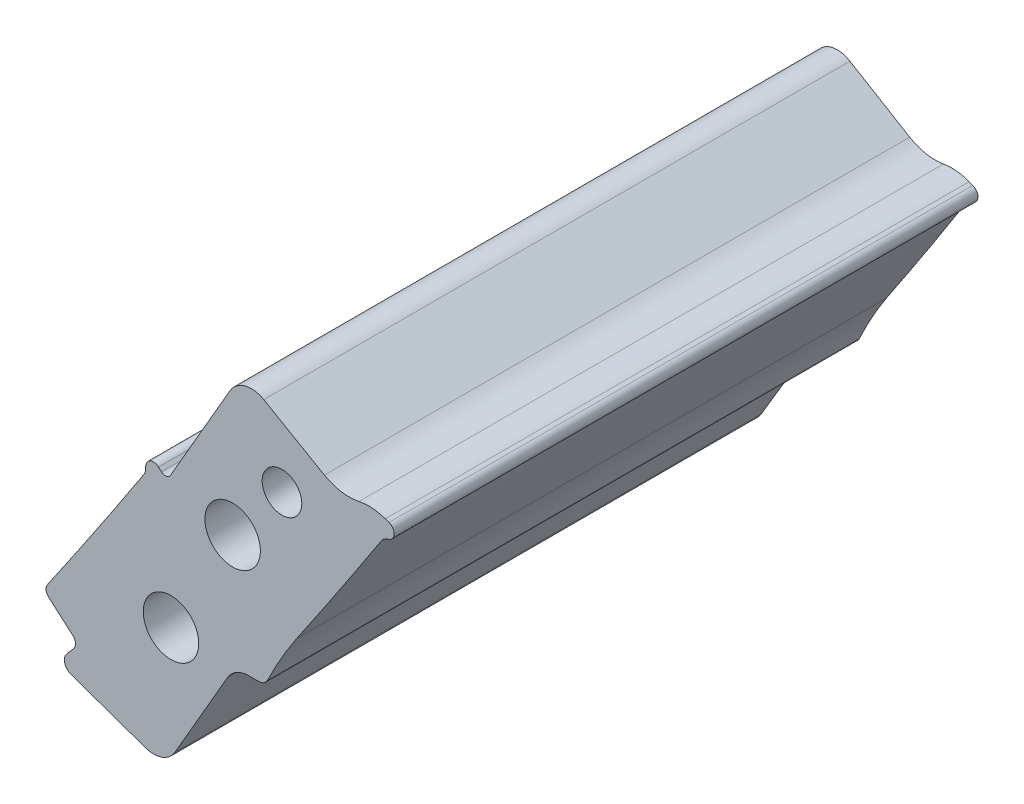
ISO-10303-21;
HEADER;
FILE_DESCRIPTION(('STEP AP214'),'2;1');
FILE_NAME('part.step','',(''),(''),'','','');
FILE_SCHEMA(('AUTOMOTIVE_DESIGN { 1 0 10303 214 1 1 1 1 }'));
ENDSEC;
DATA;
#1=APPLICATION_CONTEXT('core data for automotive mechanical design processes');
#2=APPLICATION_PROTOCOL_DEFINITION('international standard','automotive_design',2000,#1);
#3=PRODUCT_CONTEXT('',#1,'mechanical');
#4=PRODUCT('Part','Part','',(#3));
#5=PRODUCT_RELATED_PRODUCT_CATEGORY('part','',(#4));
#6=PRODUCT_DEFINITION_FORMATION('','',#4);
#7=PRODUCT_DEFINITION_CONTEXT('part definition',#1,'design');
#8=PRODUCT_DEFINITION('design','',#6,#7);
#9=PRODUCT_DEFINITION_SHAPE('','',#8);
#10=(LENGTH_UNIT() NAMED_UNIT(*) SI_UNIT(.MILLI.,.METRE.));
#11=(NAMED_UNIT(*) PLANE_ANGLE_UNIT() SI_UNIT($,.RADIAN.));
#12=(NAMED_UNIT(*) SI_UNIT($,.STERADIAN.) SOLID_ANGLE_UNIT());
#13=UNCERTAINTY_MEASURE_WITH_UNIT(LENGTH_MEASURE(1.E-05),#10,'distance_accuracy_value','');
#14=(GEOMETRIC_REPRESENTATION_CONTEXT(3) GLOBAL_UNCERTAINTY_ASSIGNED_CONTEXT((#13)) GLOBAL_UNIT_ASSIGNED_CONTEXT((#10,
#11,#12)) REPRESENTATION_CONTEXT('',''));
#15=CARTESIAN_POINT('',(0.,0.,0.));
#16=DIRECTION('',(0.,0.,1.));
#17=DIRECTION('',(1.,0.,0.));
#18=AXIS2_PLACEMENT_3D('',#15,#16,#17);
#19=CARTESIAN_POINT('',(-937.975105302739,4.0810523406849,71.9581999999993));
#20=DIRECTION('',(0.,0.,-0.999999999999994));
#21=DIRECTION('',(-1.,0.,0.));
#22=AXIS2_PLACEMENT_3D('',#19,#20,#21);
#23=CYLINDRICAL_SURFACE('',#22,1.26999999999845);
#24=CARTESIAN_POINT('',(-937.975105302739,4.0810523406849,-4.2418));
#25=DIRECTION('',(-0.0300790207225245,-0.0263983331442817,-0.999198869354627));
#26=DIRECTION('',(0.750993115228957,0.659096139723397,-0.0400202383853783));
#27=AXIS2_PLACEMENT_3D('',#24,#25,#26);
#28=ELLIPSE('',#27,1.27101825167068,1.26999999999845);
#29=CARTESIAN_POINT('',(-937.152098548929,3.11380889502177,-4.24141049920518));
#30=VERTEX_POINT('',#29);
#31=CARTESIAN_POINT('',(-937.975105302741,2.81105234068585,-4.20824723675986));
#32=VERTEX_POINT('',#31);
#33=EDGE_CURVE('E89',#30,#32,#28,.T.);
#34=ORIENTED_EDGE('',*,*,#33,.F.);
#35=CARTESIAN_POINT('',(-937.122860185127,3.13946949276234,-4.2410883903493));
#36=CARTESIAN_POINT('',(-937.127668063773,3.13511780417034,-4.24132550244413));
#37=CARTESIAN_POINT('',(-937.132508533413,3.1308035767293,-4.24143844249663));
#38=CARTESIAN_POINT('',(-937.142254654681,3.12225004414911,-4.24141597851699));
#39=CARTESIAN_POINT('',(-937.147160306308,3.11801073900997,-4.24128057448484));
#40=CARTESIAN_POINT('',(-937.152098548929,3.11380889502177,-4.24102099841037));
#41=B_SPLINE_CURVE_WITH_KNOTS('',3,(#35,#36,#37,#38,#39,#40),.UNSPECIFIED.,.F.,.F.,(4,2,4),(0.,
0.019455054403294,0.0389101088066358),.UNSPECIFIED.);
#42=CARTESIAN_POINT('',(-937.122860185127,3.13946949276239,-4.24144419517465));
#43=VERTEX_POINT('',#42);
#44=EDGE_CURVE('E84',#43,#30,#41,.T.);
#45=ORIENTED_EDGE('',*,*,#44,.F.);
#46=CARTESIAN_POINT('',(-937.975105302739,4.0810523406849,-4.24179999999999));
#47=DIRECTION('',(0.0274768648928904,0.0241145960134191,-0.999331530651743));
#48=DIRECTION('',(-0.751092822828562,-0.659183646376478,-0.0365580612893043));
#49=AXIS2_PLACEMENT_3D('',#46,#47,#48);
#50=ELLIPSE('',#49,1.27084952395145,1.26999999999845);
#51=CARTESIAN_POINT('',(-936.832813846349,3.52601159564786,-4.22378595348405));
#52=VERTEX_POINT('',#51);
#53=EDGE_CURVE('E279',#52,#43,#50,.T.);
#54=ORIENTED_EDGE('',*,*,#53,.F.);
#55=DIRECTION('',(0.,0.,-0.999999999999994));
#56=VECTOR('',#55,1.);
#57=CARTESIAN_POINT('',(-936.832813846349,3.52601159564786,71.9581999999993));
#58=LINE('',#57,#56);
#59=CARTESIAN_POINT('',(-936.832813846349,3.52601159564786,71.9581999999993));
#60=VERTEX_POINT('',#59);
#61=EDGE_CURVE('E383',#60,#52,#58,.T.);
#62=ORIENTED_EDGE('',*,*,#61,.F.);
#63=CARTESIAN_POINT('',(-937.975105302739,4.0810523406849,71.9581999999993));
#64=DIRECTION('',(0.,0.,0.999999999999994));
#65=DIRECTION('',(1.,0.,0.));
#66=AXIS2_PLACEMENT_3D('',#63,#64,#65);
#67=CIRCLE('',#66,1.26999999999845);
#68=CARTESIAN_POINT('',(-937.975105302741,2.81105234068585,71.9581999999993));
#69=VERTEX_POINT('',#68);
#70=EDGE_CURVE('E875',#69,#60,#67,.T.);
#71=ORIENTED_EDGE('',*,*,#70,.F.);
#72=DIRECTION('',(0.,0.,-0.999999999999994));
#73=VECTOR('',#72,1.);
#74=CARTESIAN_POINT('',(-937.975105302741,2.81105234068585,71.9581999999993));
#75=LINE('',#74,#73);
#76=EDGE_CURVE('E264',#69,#32,#75,.T.);
#77=ORIENTED_EDGE('',*,*,#76,.T.);
#78=EDGE_LOOP('',(#34,#45,#54,#62,#71,#77));
#79=FACE_BOUND('',#78,.T.);
#80=ADVANCED_FACE('F61',(#79),#23,.T.);
#81=CARTESIAN_POINT('',(-888.739127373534,-19.8427665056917,71.9581999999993));
#82=DIRECTION('',(0.,0.,-0.999999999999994));
#83=DIRECTION('',(-1.,0.,0.));
#84=AXIS2_PLACEMENT_3D('',#81,#82,#83);
#85=CYLINDRICAL_SURFACE('',#84,53.4705757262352);
#86=CARTESIAN_POINT('',(-888.739127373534,-19.8427665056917,-3.46534387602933));
#87=DIRECTION('',(0.0274768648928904,0.0241145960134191,-0.999331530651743));
#88=DIRECTION('',(-0.751092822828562,-0.659183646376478,-0.0365580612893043));
#89=AXIS2_PLACEMENT_3D('',#86,#87,#88);
#90=ELLIPSE('',#89,53.5063430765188,53.4705757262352);
#91=CARTESIAN_POINT('',(-933.099839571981,10.0107036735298,-3.96466658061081));
#92=VERTEX_POINT('',#91);
#93=EDGE_CURVE('E283',#92,#52,#90,.F.);
#94=ORIENTED_EDGE('',*,*,#93,.F.);
#95=DIRECTION('',(0.,0.,-0.999999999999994));
#96=VECTOR('',#95,1.);
#97=CARTESIAN_POINT('',(-933.099839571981,10.0107036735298,71.9581999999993));
#98=LINE('',#97,#96);
#99=CARTESIAN_POINT('',(-933.099839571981,10.0107036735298,71.9581999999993));
#100=VERTEX_POINT('',#99);
#101=EDGE_CURVE('E390',#100,#92,#98,.T.);
#102=ORIENTED_EDGE('',*,*,#101,.F.);
#103=CARTESIAN_POINT('',(-888.739127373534,-19.8427665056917,71.9581999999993));
#104=DIRECTION('',(0.,0.,-0.999999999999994));
#105=DIRECTION('',(1.,0.,0.));
#106=AXIS2_PLACEMENT_3D('',#103,#104,#105);
#107=CIRCLE('',#106,53.4705757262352);
#108=EDGE_CURVE('E877',#60,#100,#107,.T.);
#109=ORIENTED_EDGE('',*,*,#108,.F.);
#110=ORIENTED_EDGE('',*,*,#61,.T.);
#111=EDGE_LOOP('',(#94,#102,#109,#110));
#112=FACE_BOUND('',#111,.T.);
#113=ADVANCED_FACE('F559',(#112),#85,.F.);
#114=CARTESIAN_POINT('',(-1631.81846147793,487.596028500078,71.9581999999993));
#115=DIRECTION('',(0.,0.,-0.999999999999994));
#116=DIRECTION('',(-1.,0.,0.));
#117=AXIS2_PLACEMENT_3D('',#114,#115,#116);
#118=CYLINDRICAL_SURFACE('',#117,846.34239825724);
#119=CARTESIAN_POINT('',(-1631.81846147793,487.596028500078,-11.6516250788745));
#120=DIRECTION('',(0.0274768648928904,0.0241145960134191,-0.999331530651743));
#121=DIRECTION('',(-0.751092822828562,-0.659183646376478,-0.0365580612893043));
#122=AXIS2_PLACEMENT_3D('',#119,#120,#121);
#123=ELLIPSE('',#122,846.908530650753,846.34239825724);
#124=CARTESIAN_POINT('',(-922.196737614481,26.3667318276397,-3.27020028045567));
#125=VERTEX_POINT('',#124);
#126=EDGE_CURVE('E402',#125,#92,#123,.T.);
#127=ORIENTED_EDGE('',*,*,#126,.F.);
#128=DIRECTION('',(0.,0.,-0.999999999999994));
#129=VECTOR('',#128,1.);
#130=CARTESIAN_POINT('',(-922.196737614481,26.3667318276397,71.9581999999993));
#131=LINE('',#130,#129);
#132=CARTESIAN_POINT('',(-922.196737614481,26.3667318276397,71.9581999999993));
#133=VERTEX_POINT('',#132);
#134=EDGE_CURVE('E575',#133,#125,#131,.T.);
#135=ORIENTED_EDGE('',*,*,#134,.F.);
#136=CARTESIAN_POINT('',(-1631.81846147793,487.596028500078,71.9581999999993));
#137=DIRECTION('',(0.,0.,0.999999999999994));
#138=DIRECTION('',(1.,0.,0.));
#139=AXIS2_PLACEMENT_3D('',#136,#137,#138);
#140=CIRCLE('',#139,846.34239825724);
#141=EDGE_CURVE('E573',#100,#133,#140,.T.);
#142=ORIENTED_EDGE('',*,*,#141,.F.);
#143=ORIENTED_EDGE('',*,*,#101,.T.);
#144=EDGE_LOOP('',(#127,#135,#142,#143));
#145=FACE_BOUND('',#144,.T.);
#146=ADVANCED_FACE('F556',(#145),#118,.T.);
#147=CARTESIAN_POINT('',(-920.918929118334,25.5362010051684,71.9581999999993));
#148=DIRECTION('',(0.,0.,-0.999999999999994));
#149=DIRECTION('',(-1.,0.,0.));
#150=AXIS2_PLACEMENT_3D('',#147,#148,#149);
#151=CYLINDRICAL_SURFACE('',#150,1.5239999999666);
#152=CARTESIAN_POINT('',(-920.918929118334,25.5362010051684,-3.25510793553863));
#153=DIRECTION('',(0.0274768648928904,0.0241145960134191,-0.999331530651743));
#154=DIRECTION('',(-0.751092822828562,-0.659183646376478,-0.0365580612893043));
#155=AXIS2_PLACEMENT_3D('',#152,#153,#154);
#156=ELLIPSE('',#155,1.52501942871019,1.5239999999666);
#157=CARTESIAN_POINT('',(-921.284900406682,27.0156066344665,-3.22947127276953));
#158=VERTEX_POINT('',#157);
#159=EDGE_CURVE('E408',#158,#125,#156,.F.);
#160=ORIENTED_EDGE('',*,*,#159,.F.);
#161=DIRECTION('',(0.,0.,-0.999999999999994));
#162=VECTOR('',#161,1.);
#163=CARTESIAN_POINT('',(-921.284900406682,27.0156066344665,71.9581999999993));
#164=LINE('',#163,#162);
#165=CARTESIAN_POINT('',(-921.284900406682,27.0156066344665,71.9581999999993));
#166=VERTEX_POINT('',#165);
#167=EDGE_CURVE('E932',#166,#158,#164,.T.);
#168=ORIENTED_EDGE('',*,*,#167,.F.);
#169=CARTESIAN_POINT('',(-920.918929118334,25.5362010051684,71.9581999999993));
#170=DIRECTION('',(0.,0.,-0.999999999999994));
#171=DIRECTION('',(1.,0.,0.));
#172=AXIS2_PLACEMENT_3D('',#169,#170,#171);
#173=CIRCLE('',#172,1.5239999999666);
#174=EDGE_CURVE('E886',#133,#166,#173,.T.);
#175=ORIENTED_EDGE('',*,*,#174,.F.);
#176=ORIENTED_EDGE('',*,*,#134,.T.);
#177=EDGE_LOOP('',(#160,#168,#175,#176));
#178=FACE_BOUND('',#177,.T.);
#179=ADVANCED_FACE('F552',(#178),#151,.F.);
#180=CARTESIAN_POINT('',(-921.525039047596,27.9863452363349,71.9581999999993));
#181=DIRECTION('',(0.,0.,-0.999999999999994));
#182=DIRECTION('',(-1.,0.,0.));
#183=AXIS2_PLACEMENT_3D('',#180,#181,#182);
#184=CYLINDRICAL_SURFACE('',#183,1.00000000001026);
#185=ORIENTED_EDGE('',*,*,#167,.T.);
#186=CARTESIAN_POINT('',(-921.525039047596,27.9863452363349,-3.21264931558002));
#187=DIRECTION('',(0.0274768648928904,0.0241145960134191,-0.999331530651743));
#188=DIRECTION('',(-0.751092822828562,-0.659183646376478,-0.0365580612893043));
#189=AXIS2_PLACEMENT_3D('',#186,#187,#188);
#190=ELLIPSE('',#189,1.00066891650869,1.00000000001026);
#191=CARTESIAN_POINT('',(-921.192617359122,28.929476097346,-3.18075086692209));
#192=VERTEX_POINT('',#191);
#193=EDGE_CURVE('E579',#192,#158,#190,.T.);
#194=ORIENTED_EDGE('',*,*,#193,.F.);
#195=DIRECTION('',(0.,0.,-0.999999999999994));
#196=VECTOR('',#195,1.);
#197=CARTESIAN_POINT('',(-921.192617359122,28.929476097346,71.9581999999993));
#198=LINE('',#197,#196);
#199=CARTESIAN_POINT('',(-921.192617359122,28.929476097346,71.9581999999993));
#200=VERTEX_POINT('',#199);
#201=EDGE_CURVE('E929',#200,#192,#198,.T.);
#202=ORIENTED_EDGE('',*,*,#201,.F.);
#203=CARTESIAN_POINT('',(-921.525039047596,27.9863452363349,71.9581999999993));
#204=DIRECTION('',(0.,0.,0.999999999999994));
#205=DIRECTION('',(1.,0.,0.));
#206=AXIS2_PLACEMENT_3D('',#203,#204,#205);
#207=CIRCLE('',#206,1.00000000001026);
#208=EDGE_CURVE('E890',#166,#200,#207,.T.);
#209=ORIENTED_EDGE('',*,*,#208,.F.);
#210=EDGE_LOOP('',(#185,#194,#202,#209));
#211=FACE_BOUND('',#210,.T.);
#212=ADVANCED_FACE('F548',(#211),#184,.T.);
#213=CARTESIAN_POINT('',(-921.192617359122,28.929476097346,71.9581999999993));
#214=DIRECTION('',(-0.33242168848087,-0.94313086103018,0.));
#215=DIRECTION('',(0.94313086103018,-0.33242168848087,0.));
#216=AXIS2_PLACEMENT_3D('',#213,#214,#215);
#217=PLANE('',#216);
#218=DIRECTION('',(0.942979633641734,-0.332368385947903,0.0179071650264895));
#219=VECTOR('',#218,1.);
#220=CARTESIAN_POINT('',(-919.923814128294,28.4822659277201,-3.15665631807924));
#221=LINE('',#220,#219);
#222=CARTESIAN_POINT('',(-921.671727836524,29.0983463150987,-3.18984916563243));
#223=VERTEX_POINT('',#222);
#224=EDGE_CURVE('E585',#223,#192,#221,.T.);
#225=ORIENTED_EDGE('',*,*,#224,.F.);
#226=DIRECTION('',(0.,0.,-0.999999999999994));
#227=VECTOR('',#226,1.);
#228=CARTESIAN_POINT('',(-921.671727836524,29.0983463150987,71.9581999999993));
#229=LINE('',#228,#227);
#230=CARTESIAN_POINT('',(-921.671727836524,29.0983463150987,71.9581999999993));
#231=VERTEX_POINT('',#230);
#232=EDGE_CURVE('E925',#231,#223,#229,.T.);
#233=ORIENTED_EDGE('',*,*,#232,.F.);
#234=DIRECTION('',(-0.94313086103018,0.33242168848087,0.));
#235=VECTOR('',#234,1.);
#236=CARTESIAN_POINT('',(-921.192617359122,28.929476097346,71.9581999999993));
#237=LINE('',#236,#235);
#238=EDGE_CURVE('E893',#200,#231,#237,.T.);
#239=ORIENTED_EDGE('',*,*,#238,.F.);
#240=ORIENTED_EDGE('',*,*,#201,.T.);
#241=EDGE_LOOP('',(#225,#233,#239,#240));
#242=FACE_BOUND('',#241,.T.);
#243=ADVANCED_FACE('F544',(#242),#217,.F.);
#244=CARTESIAN_POINT('',(-923.782605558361,23.109465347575,71.9581999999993));
#245=DIRECTION('',(0.,0.,-0.999999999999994));
#246=DIRECTION('',(-1.,0.,0.));
#247=AXIS2_PLACEMENT_3D('',#244,#245,#246);
#248=CYLINDRICAL_SURFACE('',#247,6.34999999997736);
#249=CARTESIAN_POINT('',(-923.782605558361,23.109465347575,-3.39240431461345));
#250=DIRECTION('',(0.0274768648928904,0.0241145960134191,-0.999331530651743));
#251=DIRECTION('',(-0.751092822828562,-0.659183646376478,-0.0365580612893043));
#252=AXIS2_PLACEMENT_3D('',#249,#250,#251);
#253=ELLIPSE('',#252,6.35424761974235,6.34999999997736);
#254=CARTESIAN_POINT('',(-925.060867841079,29.3294770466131,-3.27745704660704));
#255=VERTEX_POINT('',#254);
#256=EDGE_CURVE('E588',#255,#223,#253,.T.);
#257=ORIENTED_EDGE('',*,*,#256,.F.);
#258=DIRECTION('',(0.,0.,-0.999999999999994));
#259=VECTOR('',#258,1.);
#260=CARTESIAN_POINT('',(-925.060867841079,29.3294770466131,71.9581999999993));
#261=LINE('',#260,#259);
#262=CARTESIAN_POINT('',(-925.060867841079,29.3294770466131,71.9581999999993));
#263=VERTEX_POINT('',#262);
#264=EDGE_CURVE('E919',#263,#255,#261,.T.);
#265=ORIENTED_EDGE('',*,*,#264,.F.);
#266=CARTESIAN_POINT('',(-923.782605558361,23.109465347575,71.9581999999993));
#267=DIRECTION('',(0.,0.,0.999999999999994));
#268=DIRECTION('',(1.,0.,0.));
#269=AXIS2_PLACEMENT_3D('',#266,#267,#268);
#270=CIRCLE('',#269,6.34999999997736);
#271=EDGE_CURVE('E896',#231,#263,#270,.T.);
#272=ORIENTED_EDGE('',*,*,#271,.F.);
#273=ORIENTED_EDGE('',*,*,#232,.T.);
#274=EDGE_LOOP('',(#257,#265,#272,#273));
#275=FACE_BOUND('',#274,.T.);
#276=ADVANCED_FACE('F540',(#275),#248,.T.);
#277=CARTESIAN_POINT('',(-926.339130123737,35.5494887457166,71.9581999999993));
#278=DIRECTION('',(0.,0.,-0.999999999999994));
#279=DIRECTION('',(-1.,0.,0.));
#280=AXIS2_PLACEMENT_3D('',#277,#278,#279);
#281=CYLINDRICAL_SURFACE('',#280,6.35000000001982);
#282=CARTESIAN_POINT('',(-926.339130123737,35.5494887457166,-3.16250977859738));
#283=DIRECTION('',(0.0274768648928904,0.0241145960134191,-0.999331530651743));
#284=DIRECTION('',(-0.751092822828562,-0.659183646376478,-0.0365580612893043));
#285=AXIS2_PLACEMENT_3D('',#282,#283,#284);
#286=ELLIPSE('',#285,6.35424761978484,6.35000000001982);
#287=CARTESIAN_POINT('',(-929.514130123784,30.0502274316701,-3.38250835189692));
#288=VERTEX_POINT('',#287);
#289=EDGE_CURVE('E602',#288,#255,#286,.F.);
#290=ORIENTED_EDGE('',*,*,#289,.F.);
#291=DIRECTION('',(0.,0.,-0.999999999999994));
#292=VECTOR('',#291,1.);
#293=CARTESIAN_POINT('',(-929.514130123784,30.0502274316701,71.9581999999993));
#294=LINE('',#293,#292);
#295=CARTESIAN_POINT('',(-929.514130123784,30.0502274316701,71.9581999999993));
#296=VERTEX_POINT('',#295);
#297=EDGE_CURVE('E915',#296,#288,#294,.T.);
#298=ORIENTED_EDGE('',*,*,#297,.F.);
#299=CARTESIAN_POINT('',(-926.339130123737,35.5494887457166,71.9581999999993));
#300=DIRECTION('',(0.,0.,-0.999999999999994));
#301=DIRECTION('',(1.,0.,0.));
#302=AXIS2_PLACEMENT_3D('',#299,#300,#301);
#303=CIRCLE('',#302,6.35000000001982);
#304=EDGE_CURVE('E899',#263,#296,#303,.T.);
#305=ORIENTED_EDGE('',*,*,#304,.F.);
#306=ORIENTED_EDGE('',*,*,#264,.T.);
#307=EDGE_LOOP('',(#290,#298,#305,#306));
#308=FACE_BOUND('',#307,.T.);
#309=ADVANCED_FACE('F536',(#308),#281,.F.);
#310=CARTESIAN_POINT('',(-929.514130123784,30.0502274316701,71.9581999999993));
#311=DIRECTION('',(-0.500000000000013,-0.866025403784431,0.));
#312=DIRECTION('',(0.866025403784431,-0.500000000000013,0.));
#313=AXIS2_PLACEMENT_3D('',#310,#311,#312);
#314=PLANE('',#313);
#315=DIRECTION('',(0.865965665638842,-0.499965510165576,0.0117454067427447));
#316=VECTOR('',#315,1.);
#317=CARTESIAN_POINT('',(-928.74783081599,29.6078043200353,-3.37211475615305));
#318=LINE('',#317,#316);
#319=CARTESIAN_POINT('',(-937.318254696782,34.5559408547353,-3.4883585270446));
#320=VERTEX_POINT('',#319);
#321=EDGE_CURVE('E606',#320,#288,#318,.T.);
#322=ORIENTED_EDGE('',*,*,#321,.F.);
#323=DIRECTION('',(0.,0.,-0.999999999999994));
#324=VECTOR('',#323,1.);
#325=CARTESIAN_POINT('',(-937.318254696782,34.5559408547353,71.9581999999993));
#326=LINE('',#325,#324);
#327=CARTESIAN_POINT('',(-937.318254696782,34.5559408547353,71.9581999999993));
#328=VERTEX_POINT('',#327);
#329=EDGE_CURVE('E912',#328,#320,#326,.T.);
#330=ORIENTED_EDGE('',*,*,#329,.F.);
#331=DIRECTION('',(-0.866025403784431,0.500000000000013,0.));
#332=VECTOR('',#331,1.);
#333=CARTESIAN_POINT('',(-929.514130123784,30.0502274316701,71.9581999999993));
#334=LINE('',#333,#332);
#335=EDGE_CURVE('E903',#296,#328,#334,.T.);
#336=ORIENTED_EDGE('',*,*,#335,.F.);
#337=ORIENTED_EDGE('',*,*,#297,.T.);
#338=EDGE_LOOP('',(#322,#330,#336,#337));
#339=FACE_BOUND('',#338,.T.);
#340=ADVANCED_FACE('F532',(#339),#314,.F.);
#341=CARTESIAN_POINT('',(-938.905754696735,31.8063101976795,71.9581999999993));
#342=DIRECTION('',(0.,0.,-0.999999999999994));
#343=DIRECTION('',(-1.,0.,0.));
#344=AXIS2_PLACEMENT_3D('',#341,#342,#343);
#345=CYLINDRICAL_SURFACE('',#344,3.17500000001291);
#346=CARTESIAN_POINT('',(-938.905754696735,31.8063101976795,-3.59835781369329));
#347=DIRECTION('',(0.0274768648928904,0.0241145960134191,-0.999331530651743));
#348=DIRECTION('',(-0.751092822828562,-0.659183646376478,-0.0365580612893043));
#349=AXIS2_PLACEMENT_3D('',#346,#347,#348);
#350=ELLIPSE('',#349,3.17712380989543,3.17500000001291);
#351=CARTESIAN_POINT('',(-941.655385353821,33.393810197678,-3.63565205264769));
#352=VERTEX_POINT('',#351);
#353=EDGE_CURVE('E610',#352,#320,#350,.T.);
#354=ORIENTED_EDGE('',*,*,#353,.F.);
#355=DIRECTION('',(0.,0.,-0.999999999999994));
#356=VECTOR('',#355,1.);
#357=CARTESIAN_POINT('',(-941.655385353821,33.393810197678,71.9581999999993));
#358=LINE('',#357,#356);
#359=CARTESIAN_POINT('',(-941.655385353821,33.393810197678,71.9581999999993));
#360=VERTEX_POINT('',#359);
#361=EDGE_CURVE('E638',#360,#352,#358,.T.);
#362=ORIENTED_EDGE('',*,*,#361,.F.);
#363=CARTESIAN_POINT('',(-938.905754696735,31.8063101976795,71.9581999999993));
#364=DIRECTION('',(0.,0.,0.999999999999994));
#365=DIRECTION('',(1.,0.,0.));
#366=AXIS2_PLACEMENT_3D('',#363,#364,#365);
#367=CIRCLE('',#366,3.17500000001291);
#368=EDGE_CURVE('E722',#328,#360,#367,.T.);
#369=ORIENTED_EDGE('',*,*,#368,.F.);
#370=ORIENTED_EDGE('',*,*,#329,.T.);
#371=EDGE_LOOP('',(#354,#362,#369,#370));
#372=FACE_BOUND('',#371,.T.);
#373=ADVANCED_FACE('F528',(#372),#345,.T.);
#374=CARTESIAN_POINT('',(-949.316504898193,20.124361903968,71.9581999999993));
#375=DIRECTION('',(0.866025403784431,-0.500000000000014,0.));
#376=DIRECTION('',(0.500000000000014,0.866025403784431,0.));
#377=AXIS2_PLACEMENT_3D('',#374,#375,#376);
#378=PLANE('',#377);
#379=DIRECTION('',(0.499700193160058,0.865506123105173,0.0346246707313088));
#380=VECTOR('',#379,1.);
#381=CARTESIAN_POINT('',(-947.999398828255,22.405656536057,-4.07523438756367));
#382=LINE('',#381,#380);
#383=CARTESIAN_POINT('',(-949.316504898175,20.1243619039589,-4.16649783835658));
#384=VERTEX_POINT('',#383);
#385=EDGE_CURVE('E615',#384,#352,#382,.T.);
#386=ORIENTED_EDGE('',*,*,#385,.F.);
#387=DIRECTION('',(0.,0.,-0.999999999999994));
#388=VECTOR('',#387,1.);
#389=CARTESIAN_POINT('',(-949.316504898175,20.1243619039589,71.9581999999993));
#390=LINE('',#389,#388);
#391=CARTESIAN_POINT('',(-949.316504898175,20.1243619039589,71.9581999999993));
#392=VERTEX_POINT('',#391);
#393=EDGE_CURVE('E631',#392,#384,#390,.T.);
#394=ORIENTED_EDGE('',*,*,#393,.F.);
#395=DIRECTION('',(-0.500000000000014,-0.866025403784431,0.));
#396=VECTOR('',#395,1.);
#397=CARTESIAN_POINT('',(-949.316504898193,20.124361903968,71.9581999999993));
#398=LINE('',#397,#396);
#399=EDGE_CURVE('E716',#360,#392,#398,.T.);
#400=ORIENTED_EDGE('',*,*,#399,.F.);
#401=ORIENTED_EDGE('',*,*,#361,.T.);
#402=EDGE_LOOP('',(#386,#394,#400,#401));
#403=FACE_BOUND('',#402,.T.);
#404=ADVANCED_FACE('F524',(#403),#378,.F.);
#405=CARTESIAN_POINT('',(-949.976416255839,20.5053619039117,71.9581999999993));
#406=DIRECTION('',(0.,0.,-0.999999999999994));
#407=DIRECTION('',(-1.,0.,0.));
#408=AXIS2_PLACEMENT_3D('',#405,#406,#407);
#409=CYLINDRICAL_SURFACE('',#408,0.761999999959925);
#410=CARTESIAN_POINT('',(-949.976416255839,20.5053619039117,-4.17544845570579));
#411=DIRECTION('',(0.0274768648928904,0.0241145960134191,-0.999331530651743));
#412=DIRECTION('',(-0.751092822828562,-0.659183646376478,-0.0365580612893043));
#413=AXIS2_PLACEMENT_3D('',#410,#411,#412);
#414=ELLIPSE('',#413,0.7625097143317,0.761999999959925);
#415=CARTESIAN_POINT('',(-950.477534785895,19.9313199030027,-4.20307888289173));
#416=VERTEX_POINT('',#415);
#417=EDGE_CURVE('E698',#416,#384,#414,.F.);
#418=ORIENTED_EDGE('',*,*,#417,.F.);
#419=DIRECTION('',(0.,0.,-0.999999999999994));
#420=VECTOR('',#419,1.);
#421=CARTESIAN_POINT('',(-950.477534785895,19.9313199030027,71.9581999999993));
#422=LINE('',#421,#420);
#423=CARTESIAN_POINT('',(-950.477534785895,19.9313199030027,71.9581999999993));
#424=VERTEX_POINT('',#423);
#425=EDGE_CURVE('E625',#424,#416,#422,.T.);
#426=ORIENTED_EDGE('',*,*,#425,.F.);
#427=CARTESIAN_POINT('',(-949.976416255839,20.5053619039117,71.9581999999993));
#428=DIRECTION('',(0.,0.,-0.999999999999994));
#429=DIRECTION('',(1.,0.,0.));
#430=AXIS2_PLACEMENT_3D('',#427,#428,#429);
#431=CIRCLE('',#430,0.761999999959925);
#432=EDGE_CURVE('E711',#392,#424,#431,.T.);
#433=ORIENTED_EDGE('',*,*,#432,.F.);
#434=ORIENTED_EDGE('',*,*,#393,.T.);
#435=EDGE_LOOP('',(#418,#426,#433,#434));
#436=FACE_BOUND('',#435,.T.);
#437=ADVANCED_FACE('F520',(#436),#409,.F.);
#438=CARTESIAN_POINT('',(-950.860229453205,20.265398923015,71.9581999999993));
#439=DIRECTION('',(-0.657635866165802,-0.753335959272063,0.));
#440=DIRECTION('',(0.753335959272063,-0.657635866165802,0.));
#441=AXIS2_PLACEMENT_3D('',#438,#439,#440);
#442=PLANE('',#441);
#443=DIRECTION('',(0.753327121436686,-0.65762815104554,0.00484386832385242));
#444=VECTOR('',#443,1.);
#445=CARTESIAN_POINT('',(-950.582306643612,20.0227820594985,-4.20375256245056));
#446=LINE('',#445,#444);
#447=CARTESIAN_POINT('',(-950.860229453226,20.2653989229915,-4.20553959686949));
#448=VERTEX_POINT('',#447);
#449=EDGE_CURVE('E693',#448,#416,#446,.T.);
#450=ORIENTED_EDGE('',*,*,#449,.F.);
#451=DIRECTION('',(0.,0.,-0.999999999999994));
#452=VECTOR('',#451,1.);
#453=CARTESIAN_POINT('',(-950.860229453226,20.2653989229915,71.9581999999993));
#454=LINE('',#453,#452);
#455=CARTESIAN_POINT('',(-950.860229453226,20.2653989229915,71.9581999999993));
#456=VERTEX_POINT('',#455);
#457=EDGE_CURVE('E632',#456,#448,#454,.T.);
#458=ORIENTED_EDGE('',*,*,#457,.F.);
#459=DIRECTION('',(-0.753335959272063,0.657635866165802,0.));
#460=VECTOR('',#459,1.);
#461=CARTESIAN_POINT('',(-950.860229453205,20.265398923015,71.9581999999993));
#462=LINE('',#461,#460);
#463=EDGE_CURVE('E715',#424,#456,#462,.T.);
#464=ORIENTED_EDGE('',*,*,#463,.F.);
#465=ORIENTED_EDGE('',*,*,#425,.T.);
#466=EDGE_LOOP('',(#450,#458,#464,#465));
#467=FACE_BOUND('',#466,.T.);
#468=ADVANCED_FACE('F516',(#467),#442,.F.);
#469=CARTESIAN_POINT('',(-951.517865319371,19.5120629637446,71.9581999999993));
#470=DIRECTION('',(0.,0.,-0.999999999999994));
#471=DIRECTION('',(-1.,0.,0.));
#472=AXIS2_PLACEMENT_3D('',#469,#470,#471);
#473=CYLINDRICAL_SURFACE('',#472,0.999999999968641);
#474=CARTESIAN_POINT('',(-951.517865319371,19.5120629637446,-4.2418));
#475=DIRECTION('',(-0.0300790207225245,-0.0263983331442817,-0.999198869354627));
#476=DIRECTION('',(0.750993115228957,0.659096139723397,-0.0400202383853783));
#477=AXIS2_PLACEMENT_3D('',#474,#475,#476);
#478=ELLIPSE('',#477,1.00080177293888,0.999999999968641);
#479=CARTESIAN_POINT('',(-952.514995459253,19.4363563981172,-4.20978312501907));
#480=VERTEX_POINT('',#479);
#481=CARTESIAN_POINT('',(-952.191983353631,20.2506865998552,-4.24141049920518));
#482=VERTEX_POINT('',#481);
#483=EDGE_CURVE('E648',#480,#482,#478,.T.);
#484=ORIENTED_EDGE('',*,*,#483,.F.);
#485=DIRECTION('',(0.,0.,-0.999999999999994));
#486=VECTOR('',#485,1.);
#487=CARTESIAN_POINT('',(-952.514995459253,19.4363563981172,71.9581999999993));
#488=LINE('',#487,#486);
#489=CARTESIAN_POINT('',(-952.514995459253,19.4363563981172,71.9581999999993));
#490=VERTEX_POINT('',#489);
#491=EDGE_CURVE('E740',#490,#480,#488,.T.);
#492=ORIENTED_EDGE('',*,*,#491,.F.);
#493=CARTESIAN_POINT('',(-951.517865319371,19.5120629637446,71.9581999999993));
#494=DIRECTION('',(0.,0.,0.999999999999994));
#495=DIRECTION('',(1.,0.,0.));
#496=AXIS2_PLACEMENT_3D('',#493,#494,#495);
#497=CIRCLE('',#496,0.999999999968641);
#498=EDGE_CURVE('E720',#456,#490,#497,.T.);
#499=ORIENTED_EDGE('',*,*,#498,.F.);
#500=ORIENTED_EDGE('',*,*,#457,.T.);
#501=CARTESIAN_POINT('',(-951.517865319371,19.5120629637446,-4.24179999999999));
#502=DIRECTION('',(0.0274768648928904,0.0241145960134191,-0.999331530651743));
#503=DIRECTION('',(-0.751092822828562,-0.659183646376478,-0.0365580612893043));
#504=AXIS2_PLACEMENT_3D('',#501,#502,#503);
#505=ELLIPSE('',#504,1.00066891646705,0.999999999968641);
#506=CARTESIAN_POINT('',(-952.162744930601,20.2763471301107,-4.24144419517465));
#507=VERTEX_POINT('',#506);
#508=EDGE_CURVE('E690',#507,#448,#505,.T.);
#509=ORIENTED_EDGE('',*,*,#508,.F.);
#510=CARTESIAN_POINT('',(-952.191983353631,20.2506865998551,-4.24102099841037));
#511=CARTESIAN_POINT('',(-952.187193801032,20.2550578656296,-4.24128057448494));
#512=CARTESIAN_POINT('',(-952.182362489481,20.2593818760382,-4.24141597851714));
#513=CARTESIAN_POINT('',(-952.172616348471,20.2679353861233,-4.24143844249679));
#514=CARTESIAN_POINT('',(-952.167701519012,20.2721648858,-4.24132550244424));
#515=CARTESIAN_POINT('',(-952.162744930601,20.2763471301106,-4.24108839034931));
#516=B_SPLINE_CURVE_WITH_KNOTS('',3,(#510,#511,#512,#513,#514,#515),.UNSPECIFIED.,.F.,.F.,(4,2,
4),(0.,0.0194554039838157,0.0389108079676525),.UNSPECIFIED.);
#517=EDGE_CURVE('E12',#482,#507,#516,.T.);
#518=ORIENTED_EDGE('',*,*,#517,.F.);
#519=EDGE_LOOP('',(#484,#492,#499,#500,#509,#518));
#520=FACE_BOUND('',#519,.T.);
#521=ADVANCED_FACE('F511',(#520),#473,.T.);
#522=CARTESIAN_POINT('',(-954.034621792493,19.3209795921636,71.9581999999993));
#523=DIRECTION('',(0.,0.,-0.999999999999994));
#524=DIRECTION('',(-1.,0.,0.));
#525=AXIS2_PLACEMENT_3D('',#522,#523,#524);
#526=CYLINDRICAL_SURFACE('',#525,1.52400000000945);
#527=CARTESIAN_POINT('',(-954.034621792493,19.3209795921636,-4.16098940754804));
#528=DIRECTION('',(-0.0300790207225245,-0.0263983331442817,-0.999198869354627));
#529=DIRECTION('',(0.750993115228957,0.659096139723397,-0.0400202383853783));
#530=AXIS2_PLACEMENT_3D('',#527,#528,#529);
#531=ELLIPSE('',#530,1.52522190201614,1.52400000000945);
#532=CARTESIAN_POINT('',(-952.758361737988,18.4880712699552,-4.17740381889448));
#533=VERTEX_POINT('',#532);
#534=EDGE_CURVE('E819',#533,#480,#531,.F.);
#535=ORIENTED_EDGE('',*,*,#534,.F.);
#536=DIRECTION('',(0.,0.,-0.999999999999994));
#537=VECTOR('',#536,1.);
#538=CARTESIAN_POINT('',(-952.758361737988,18.4880712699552,71.9581999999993));
#539=LINE('',#538,#537);
#540=CARTESIAN_POINT('',(-952.758361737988,18.4880712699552,71.9581999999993));
#541=VERTEX_POINT('',#540);
#542=EDGE_CURVE('E744',#541,#533,#539,.T.);
#543=ORIENTED_EDGE('',*,*,#542,.F.);
#544=CARTESIAN_POINT('',(-954.034621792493,19.3209795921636,71.9581999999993));
#545=DIRECTION('',(0.,0.,-0.999999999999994));
#546=DIRECTION('',(1.,0.,0.));
#547=AXIS2_PLACEMENT_3D('',#544,#545,#546);
#548=CIRCLE('',#547,1.52400000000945);
#549=EDGE_CURVE('E729',#490,#541,#548,.T.);
#550=ORIENTED_EDGE('',*,*,#549,.F.);
#551=ORIENTED_EDGE('',*,*,#491,.T.);
#552=EDGE_LOOP('',(#535,#543,#550,#551));
#553=FACE_BOUND('',#552,.T.);
#554=ADVANCED_FACE('F508',(#553),#526,.F.);
#555=CARTESIAN_POINT('',(-1671.56946147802,487.596028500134,71.9581999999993));
#556=DIRECTION('',(0.,0.,-0.999999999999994));
#557=DIRECTION('',(-1.,0.,0.));
#558=AXIS2_PLACEMENT_3D('',#555,#556,#557);
#559=CYLINDRICAL_SURFACE('',#558,858.34239825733);
#560=CARTESIAN_POINT('',(-1671.56946147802,487.596028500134,5.06746836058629));
#561=DIRECTION('',(-0.0300790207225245,-0.0263983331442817,-0.999198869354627));
#562=DIRECTION('',(0.750993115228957,0.659096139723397,-0.0400202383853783));
#563=AXIS2_PLACEMENT_3D('',#560,#561,#562);
#564=ELLIPSE('',#563,859.030593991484,858.34239825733);
#565=CARTESIAN_POINT('',(-965.170191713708,-0.0019045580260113,-3.31527290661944));
#566=VERTEX_POINT('',#565);
#567=EDGE_CURVE('E815',#566,#533,#564,.F.);
#568=ORIENTED_EDGE('',*,*,#567,.F.);
#569=DIRECTION('',(0.,0.,-0.999999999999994));
#570=VECTOR('',#569,1.);
#571=CARTESIAN_POINT('',(-965.170191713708,-0.0019045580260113,71.9581999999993));
#572=LINE('',#571,#570);
#573=CARTESIAN_POINT('',(-965.170191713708,-0.0019045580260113,71.9581999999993));
#574=VERTEX_POINT('',#573);
#575=EDGE_CURVE('E748',#574,#566,#572,.T.);
#576=ORIENTED_EDGE('',*,*,#575,.F.);
#577=CARTESIAN_POINT('',(-1671.56946147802,487.596028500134,71.9581999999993));
#578=DIRECTION('',(0.,0.,-0.999999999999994));
#579=DIRECTION('',(1.,0.,0.));
#580=AXIS2_PLACEMENT_3D('',#577,#578,#579);
#581=CIRCLE('',#580,858.34239825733);
#582=EDGE_CURVE('E733',#541,#574,#581,.T.);
#583=ORIENTED_EDGE('',*,*,#582,.F.);
#584=ORIENTED_EDGE('',*,*,#542,.T.);
#585=EDGE_LOOP('',(#568,#576,#583,#584));
#586=FACE_BOUND('',#585,.T.);
#587=ADVANCED_FACE('F504',(#586),#559,.F.);
#588=CARTESIAN_POINT('',(-964.34721096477,-0.56997382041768,71.9581999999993));
#589=DIRECTION('',(0.,0.,-0.999999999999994));
#590=DIRECTION('',(-1.,0.,0.));
#591=AXIS2_PLACEMENT_3D('',#588,#589,#590);
#592=CYLINDRICAL_SURFACE('',#591,0.999999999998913);
#593=CARTESIAN_POINT('',(-964.34721096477,-0.56997382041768,-3.32503910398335));
#594=DIRECTION('',(-0.0300790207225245,-0.0263983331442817,-0.999198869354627));
#595=DIRECTION('',(0.750993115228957,0.659096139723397,-0.0400202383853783));
#596=AXIS2_PLACEMENT_3D('',#593,#594,#595);
#597=ELLIPSE('',#596,1.00080177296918,0.999999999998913);
#598=CARTESIAN_POINT('',(-965.002901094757,-1.3250039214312,-3.28535325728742));
#599=VERTEX_POINT('',#598);
#600=EDGE_CURVE('E810',#599,#566,#597,.T.);
#601=ORIENTED_EDGE('',*,*,#600,.F.);
#602=DIRECTION('',(0.,0.,-0.999999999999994));
#603=VECTOR('',#602,1.);
#604=CARTESIAN_POINT('',(-965.002901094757,-1.3250039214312,71.9581999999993));
#605=LINE('',#604,#603);
#606=CARTESIAN_POINT('',(-965.002901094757,-1.3250039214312,71.9581999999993));
#607=VERTEX_POINT('',#606);
#608=EDGE_CURVE('E753',#607,#599,#605,.T.);
#609=ORIENTED_EDGE('',*,*,#608,.F.);
#610=CARTESIAN_POINT('',(-964.34721096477,-0.56997382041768,71.9581999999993));
#611=DIRECTION('',(0.,0.,0.999999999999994));
#612=DIRECTION('',(1.,0.,0.));
#613=AXIS2_PLACEMENT_3D('',#610,#611,#612);
#614=CIRCLE('',#613,0.999999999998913);
#615=EDGE_CURVE('E842',#574,#607,#614,.T.);
#616=ORIENTED_EDGE('',*,*,#615,.F.);
#617=ORIENTED_EDGE('',*,*,#575,.T.);
#618=EDGE_LOOP('',(#601,#609,#616,#617));
#619=FACE_BOUND('',#618,.T.);
#620=ADVANCED_FACE('F500',(#619),#592,.T.);
#621=CARTESIAN_POINT('',(-961.902620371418,-4.01737799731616,71.9581999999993));
#622=DIRECTION('',(0.65569012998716,0.755030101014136,0.));
#623=DIRECTION('',(-0.755030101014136,0.65569012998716,0.));
#624=AXIS2_PLACEMENT_3D('',#621,#622,#623);
#625=PLANE('',#624);
#626=DIRECTION('',(-0.755019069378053,0.655680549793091,0.00540569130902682));
#627=VECTOR('',#626,1.);
#628=CARTESIAN_POINT('',(-962.209810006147,-3.75060557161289,-3.30535088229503));
#629=LINE('',#628,#627);
#630=CARTESIAN_POINT('',(-961.902620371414,-4.01737799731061,-3.30755026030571));
#631=VERTEX_POINT('',#630);
#632=EDGE_CURVE('E806',#631,#599,#629,.T.);
#633=ORIENTED_EDGE('',*,*,#632,.F.);
#634=DIRECTION('',(0.,0.,-0.999999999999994));
#635=VECTOR('',#634,1.);
#636=CARTESIAN_POINT('',(-961.902620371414,-4.01737799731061,71.9581999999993));
#637=LINE('',#636,#635);
#638=CARTESIAN_POINT('',(-961.902620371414,-4.01737799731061,71.9581999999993));
#639=VERTEX_POINT('',#638);
#640=EDGE_CURVE('E757',#639,#631,#637,.T.);
#641=ORIENTED_EDGE('',*,*,#640,.F.);
#642=DIRECTION('',(0.755030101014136,-0.65569012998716,0.));
#643=VECTOR('',#642,1.);
#644=CARTESIAN_POINT('',(-961.902620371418,-4.01737799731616,71.9581999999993));
#645=LINE('',#644,#643);
#646=EDGE_CURVE('E845',#607,#639,#645,.T.);
#647=ORIENTED_EDGE('',*,*,#646,.F.);
#648=ORIENTED_EDGE('',*,*,#608,.T.);
#649=EDGE_LOOP('',(#633,#641,#647,#648));
#650=FACE_BOUND('',#649,.T.);
#651=ADVANCED_FACE('F496',(#650),#625,.F.);
#652=CARTESIAN_POINT('',(-962.568801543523,-4.78448857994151,71.9581999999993));
#653=DIRECTION('',(0.,0.,-0.999999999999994));
#654=DIRECTION('',(-1.,0.,0.));
#655=AXIS2_PLACEMENT_3D('',#652,#653,#654);
#656=CYLINDRICAL_SURFACE('',#655,1.01600000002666);
#657=CARTESIAN_POINT('',(-962.568801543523,-4.78448857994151,-3.2672294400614));
#658=DIRECTION('',(-0.0300790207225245,-0.0263983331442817,-0.999198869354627));
#659=DIRECTION('',(0.750993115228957,0.659096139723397,-0.0400202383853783));
#660=AXIS2_PLACEMENT_3D('',#657,#658,#659);
#661=ELLIPSE('',#660,1.01681460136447,1.01600000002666);
#662=CARTESIAN_POINT('',(-961.801690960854,-5.45066975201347,-3.27272170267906));
#663=VERTEX_POINT('',#662);
#664=EDGE_CURVE('E799',#663,#631,#661,.F.);
#665=ORIENTED_EDGE('',*,*,#664,.F.);
#666=DIRECTION('',(0.,0.,-0.999999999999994));
#667=VECTOR('',#666,1.);
#668=CARTESIAN_POINT('',(-961.801690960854,-5.45066975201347,71.9581999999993));
#669=LINE('',#668,#667);
#670=CARTESIAN_POINT('',(-961.801690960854,-5.45066975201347,71.9581999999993));
#671=VERTEX_POINT('',#670);
#672=EDGE_CURVE('E762',#671,#663,#669,.T.);
#673=ORIENTED_EDGE('',*,*,#672,.F.);
#674=CARTESIAN_POINT('',(-962.568801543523,-4.78448857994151,71.9581999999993));
#675=DIRECTION('',(0.,0.,-0.999999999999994));
#676=DIRECTION('',(1.,0.,0.));
#677=AXIS2_PLACEMENT_3D('',#674,#675,#676);
#678=CIRCLE('',#677,1.01600000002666);
#679=EDGE_CURVE('E849',#639,#671,#678,.T.);
#680=ORIENTED_EDGE('',*,*,#679,.F.);
#681=ORIENTED_EDGE('',*,*,#640,.T.);
#682=EDGE_LOOP('',(#665,#673,#680,#681));
#683=FACE_BOUND('',#682,.T.);
#684=ADVANCED_FACE('F492',(#683),#656,.F.);
#685=CARTESIAN_POINT('',(-962.671637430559,-6.45241698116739,71.9581999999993));
#686=DIRECTION('',(0.755030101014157,-0.65569012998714,0.));
#687=DIRECTION('',(0.65569012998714,0.755030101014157,0.));
#688=AXIS2_PLACEMENT_3D('',#685,#686,#687);
#689=PLANE('',#688);
#690=DIRECTION('',(0.655174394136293,0.754436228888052,-0.0396546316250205));
#691=VECTOR('',#690,1.);
#692=CARTESIAN_POINT('',(-964.62482139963,-8.70151700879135,-3.10185086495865));
#693=LINE('',#692,#691);
#694=CARTESIAN_POINT('',(-962.671637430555,-6.45241698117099,-3.22006792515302));
#695=VERTEX_POINT('',#694);
#696=EDGE_CURVE('E796',#695,#663,#693,.T.);
#697=ORIENTED_EDGE('',*,*,#696,.F.);
#698=DIRECTION('',(0.,0.,-0.999999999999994));
#699=VECTOR('',#698,1.);
#700=CARTESIAN_POINT('',(-962.671637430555,-6.45241698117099,71.9581999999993));
#701=LINE('',#700,#699);
#702=CARTESIAN_POINT('',(-962.671637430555,-6.45241698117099,71.9581999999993));
#703=VERTEX_POINT('',#702);
#704=EDGE_CURVE('E769',#703,#695,#701,.T.);
#705=ORIENTED_EDGE('',*,*,#704,.F.);
#706=DIRECTION('',(-0.65569012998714,-0.755030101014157,0.));
#707=VECTOR('',#706,1.);
#708=CARTESIAN_POINT('',(-962.671637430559,-6.45241698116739,71.9581999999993));
#709=LINE('',#708,#707);
#710=EDGE_CURVE('E854',#671,#703,#709,.T.);
#711=ORIENTED_EDGE('',*,*,#710,.F.);
#712=ORIENTED_EDGE('',*,*,#672,.T.);
#713=EDGE_LOOP('',(#697,#705,#711,#712));
#714=FACE_BOUND('',#713,.T.);
#715=ADVANCED_FACE('F488',(#714),#689,.F.);
#716=CARTESIAN_POINT('',(-961.712749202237,-7.28514344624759,71.9581999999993));
#717=DIRECTION('',(0.,0.,-0.999999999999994));
#718=DIRECTION('',(-1.,0.,0.));
#719=AXIS2_PLACEMENT_3D('',#716,#717,#718);
#720=CYLINDRICAL_SURFACE('',#719,1.27000000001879);
#721=ORIENTED_EDGE('',*,*,#704,.T.);
#722=CARTESIAN_POINT('',(-961.712749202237,-7.28514344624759,-3.22693325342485));
#723=DIRECTION('',(-0.0300790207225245,-0.0263983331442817,-0.999198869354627));
#724=DIRECTION('',(0.750993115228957,0.659096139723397,-0.0400202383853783));
#725=AXIS2_PLACEMENT_3D('',#722,#723,#724);
#726=ELLIPSE('',#725,1.27101825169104,1.27000000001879);
#727=CARTESIAN_POINT('',(-962.134924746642,-8.4829196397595,-3.18257979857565));
#728=VERTEX_POINT('',#727);
#729=EDGE_CURVE('E791',#728,#695,#726,.T.);
#730=ORIENTED_EDGE('',*,*,#729,.F.);
#731=DIRECTION('',(0.,0.,-0.999999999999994));
#732=VECTOR('',#731,1.);
#733=CARTESIAN_POINT('',(-962.134924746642,-8.4829196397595,71.9581999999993));
#734=LINE('',#733,#732);
#735=CARTESIAN_POINT('',(-962.134924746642,-8.4829196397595,71.9581999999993));
#736=VERTEX_POINT('',#735);
#737=EDGE_CURVE('E774',#736,#728,#734,.T.);
#738=ORIENTED_EDGE('',*,*,#737,.F.);
#739=CARTESIAN_POINT('',(-961.712749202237,-7.28514344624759,71.9581999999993));
#740=DIRECTION('',(0.,0.,0.999999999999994));
#741=DIRECTION('',(1.,0.,0.));
#742=AXIS2_PLACEMENT_3D('',#739,#740,#741);
#743=CIRCLE('',#742,1.27000000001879);
#744=EDGE_CURVE('E857',#703,#736,#743,.T.);
#745=ORIENTED_EDGE('',*,*,#744,.F.);
#746=EDGE_LOOP('',(#721,#730,#738,#745));
#747=FACE_BOUND('',#746,.T.);
#748=ADVANCED_FACE('F484',(#747),#720,.T.);
#749=CARTESIAN_POINT('',(-962.134924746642,-8.4829196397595,71.9581999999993));
#750=DIRECTION('',(0.332421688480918,0.943130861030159,0.));
#751=DIRECTION('',(-0.943130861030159,0.332421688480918,0.));
#752=AXIS2_PLACEMENT_3D('',#749,#750,#751);
#753=PLANE('',#752);
#754=DIRECTION('',(-0.942949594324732,0.332357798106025,0.0196050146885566));
#755=VECTOR('',#754,1.);
#756=CARTESIAN_POINT('',(-963.524017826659,-7.99331137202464,-3.1536989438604));
#757=LINE('',#756,#755);
#758=CARTESIAN_POINT('',(-952.543385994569,-11.8636122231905,-3.38199900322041));
#759=VERTEX_POINT('',#758);
#760=EDGE_CURVE('E297',#759,#728,#757,.T.);
#761=ORIENTED_EDGE('',*,*,#760,.F.);
#762=DIRECTION('',(0.,0.,-0.999999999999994));
#763=VECTOR('',#762,1.);
#764=CARTESIAN_POINT('',(-952.543385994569,-11.8636122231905,71.9581999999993));
#765=LINE('',#764,#763);
#766=CARTESIAN_POINT('',(-952.543385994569,-11.8636122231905,71.9581999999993));
#767=VERTEX_POINT('',#766);
#768=EDGE_CURVE('E777',#767,#759,#765,.T.);
#769=ORIENTED_EDGE('',*,*,#768,.F.);
#770=DIRECTION('',(0.943130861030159,-0.332421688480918,0.));
#771=VECTOR('',#770,1.);
#772=CARTESIAN_POINT('',(-962.134924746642,-8.4829196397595,71.9581999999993));
#773=LINE('',#772,#771);
#774=EDGE_CURVE('E860',#736,#767,#773,.T.);
#775=ORIENTED_EDGE('',*,*,#774,.F.);
#776=ORIENTED_EDGE('',*,*,#737,.T.);
#777=EDGE_LOOP('',(#761,#769,#775,#776));
#778=FACE_BOUND('',#777,.T.);
#779=ADVANCED_FACE('F480',(#778),#753,.F.);
#780=CARTESIAN_POINT('',(-951.48794713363,-8.86917173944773,71.9581999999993));
#781=DIRECTION('',(0.,0.,-0.999999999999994));
#782=DIRECTION('',(-1.,0.,0.));
#783=AXIS2_PLACEMENT_3D('',#780,#781,#782);
#784=CYLINDRICAL_SURFACE('',#783,3.1749999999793);
#785=CARTESIAN_POINT('',(-951.48794713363,-8.86917173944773,-3.49288264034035));
#786=DIRECTION('',(-0.0300790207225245,-0.0263983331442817,-0.999198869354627));
#787=DIRECTION('',(0.750993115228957,0.659096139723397,-0.0400202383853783));
#788=AXIS2_PLACEMENT_3D('',#785,#786,#787);
#789=ELLIPSE('',#788,3.17754562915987,3.1749999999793);
#790=CARTESIAN_POINT('',(-948.738316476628,-10.4566717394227,-3.53371419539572));
#791=VERTEX_POINT('',#790);
#792=EDGE_CURVE('E292',#791,#759,#789,.T.);
#793=ORIENTED_EDGE('',*,*,#792,.F.);
#794=DIRECTION('',(0.,0.,-0.999999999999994));
#795=VECTOR('',#794,1.);
#796=CARTESIAN_POINT('',(-948.738316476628,-10.4566717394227,71.9581999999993));
#797=LINE('',#796,#795);
#798=CARTESIAN_POINT('',(-948.738316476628,-10.4566717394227,71.9581999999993));
#799=VERTEX_POINT('',#798);
#800=EDGE_CURVE('E313',#799,#791,#797,.T.);
#801=ORIENTED_EDGE('',*,*,#800,.F.);
#802=CARTESIAN_POINT('',(-951.48794713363,-8.86917173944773,71.9581999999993));
#803=DIRECTION('',(0.,0.,0.999999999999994));
#804=DIRECTION('',(-1.,0.,0.));
#805=AXIS2_PLACEMENT_3D('',#802,#803,#804);
#806=CIRCLE('',#805,3.1749999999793);
#807=EDGE_CURVE('E863',#767,#799,#806,.T.);
#808=ORIENTED_EDGE('',*,*,#807,.F.);
#809=ORIENTED_EDGE('',*,*,#768,.T.);
#810=EDGE_LOOP('',(#793,#801,#808,#809));
#811=FACE_BOUND('',#810,.T.);
#812=ADVANCED_FACE('F476',(#811),#784,.T.);
#813=CARTESIAN_POINT('',(-948.738316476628,-10.4566717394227,71.9581999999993));
#814=DIRECTION('',(-0.866025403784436,0.500000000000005,0.));
#815=DIRECTION('',(-0.500000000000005,-0.866025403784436,0.));
#816=AXIS2_PLACEMENT_3D('',#813,#814,#815);
#817=PLANE('',#816);
#818=DIRECTION('',(-0.499640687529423,-0.865403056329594,0.0379042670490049));
#819=VECTOR('',#818,1.);
#820=CARTESIAN_POINT('',(-950.168021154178,-12.9329928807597,-3.42525243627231));
#821=LINE('',#820,#819);
#822=CARTESIAN_POINT('',(-941.99473595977,1.22355234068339,-4.04530278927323));
#823=VERTEX_POINT('',#822);
#824=EDGE_CURVE('E274',#823,#791,#821,.T.);
#825=ORIENTED_EDGE('',*,*,#824,.F.);
#826=DIRECTION('',(0.,0.,-0.999999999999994));
#827=VECTOR('',#826,1.);
#828=CARTESIAN_POINT('',(-941.99473595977,1.22355234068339,71.9581999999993));
#829=LINE('',#828,#827);
#830=CARTESIAN_POINT('',(-941.99473595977,1.22355234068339,71.9581999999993));
#831=VERTEX_POINT('',#830);
#832=EDGE_CURVE('E263',#831,#823,#829,.T.);
#833=ORIENTED_EDGE('',*,*,#832,.F.);
#834=DIRECTION('',(0.500000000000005,0.866025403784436,0.));
#835=VECTOR('',#834,1.);
#836=CARTESIAN_POINT('',(-948.738316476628,-10.4566717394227,71.9581999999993));
#837=LINE('',#836,#835);
#838=EDGE_CURVE('E788',#799,#831,#837,.T.);
#839=ORIENTED_EDGE('',*,*,#838,.F.);
#840=ORIENTED_EDGE('',*,*,#800,.T.);
#841=EDGE_LOOP('',(#825,#833,#839,#840));
#842=FACE_BOUND('',#841,.T.);
#843=ADVANCED_FACE('F473',(#842),#817,.F.);
#844=CARTESIAN_POINT('',(-939.245105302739,-0.363947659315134,71.9581999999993));
#845=DIRECTION('',(0.,0.,-0.999999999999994));
#846=DIRECTION('',(-1.,0.,0.));
#847=AXIS2_PLACEMENT_3D('',#844,#845,#846);
#848=CYLINDRICAL_SURFACE('',#847,3.17500000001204);
#849=CARTESIAN_POINT('',(-939.245105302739,-0.363947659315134,-4.08613434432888));
#850=DIRECTION('',(-0.0300790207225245,-0.0263983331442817,-0.999198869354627));
#851=DIRECTION('',(0.750993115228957,0.659096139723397,-0.0400202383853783));
#852=AXIS2_PLACEMENT_3D('',#849,#850,#851);
#853=ELLIPSE('',#852,3.17754562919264,3.17500000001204);
#854=CARTESIAN_POINT('',(-939.245105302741,2.81105234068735,-4.17001625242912));
#855=VERTEX_POINT('',#854);
#856=EDGE_CURVE('E268',#855,#823,#853,.F.);
#857=ORIENTED_EDGE('',*,*,#856,.F.);
#858=DIRECTION('',(0.,0.,-0.999999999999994));
#859=VECTOR('',#858,1.);
#860=CARTESIAN_POINT('',(-939.245105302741,2.81105234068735,71.9581999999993));
#861=LINE('',#860,#859);
#862=CARTESIAN_POINT('',(-939.245105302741,2.81105234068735,71.9581999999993));
#863=VERTEX_POINT('',#862);
#864=EDGE_CURVE('E253',#863,#855,#861,.T.);
#865=ORIENTED_EDGE('',*,*,#864,.F.);
#866=CARTESIAN_POINT('',(-939.245105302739,-0.363947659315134,71.9581999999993));
#867=DIRECTION('',(0.,0.,-0.999999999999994));
#868=DIRECTION('',(-1.,0.,0.));
#869=AXIS2_PLACEMENT_3D('',#866,#867,#868);
#870=CIRCLE('',#869,3.17500000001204);
#871=EDGE_CURVE('E867',#831,#863,#870,.T.);
#872=ORIENTED_EDGE('',*,*,#871,.F.);
#873=ORIENTED_EDGE('',*,*,#832,.T.);
#874=EDGE_LOOP('',(#857,#865,#872,#873));
#875=FACE_BOUND('',#874,.T.);
#876=ADVANCED_FACE('F269',(#875),#848,.F.);
#877=CARTESIAN_POINT('',(-939.245105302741,2.81105234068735,71.9581999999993));
#878=DIRECTION('',(0.,1.,0.));
#879=DIRECTION('',(-1.,0.,0.));
#880=AXIS2_PLACEMENT_3D('',#877,#878,#879);
#881=PLANE('',#880);
#882=DIRECTION('',(-0.999547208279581,0.,0.030089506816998));
#883=VECTOR('',#882,1.);
#884=CARTESIAN_POINT('',(-941.534728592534,2.8110523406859,-4.10109140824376));
#885=LINE('',#884,#883);
#886=EDGE_CURVE('E258',#32,#855,#885,.T.);
#887=ORIENTED_EDGE('',*,*,#886,.F.);
#888=ORIENTED_EDGE('',*,*,#76,.F.);
#889=DIRECTION('',(1.,0.,0.));
#890=VECTOR('',#889,1.);
#891=CARTESIAN_POINT('',(-939.245105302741,2.81105234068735,71.9581999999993));
#892=LINE('',#891,#890);
#893=EDGE_CURVE('E259',#863,#69,#892,.T.);
#894=ORIENTED_EDGE('',*,*,#893,.F.);
#895=ORIENTED_EDGE('',*,*,#864,.T.);
#896=EDGE_LOOP('',(#887,#888,#894,#895));
#897=FACE_BOUND('',#896,.T.);
#898=ADVANCED_FACE('F255',(#897),#881,.F.);
#899=CARTESIAN_POINT('',(-934.974,25.4000000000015,71.9581999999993));
#900=DIRECTION('',(0.,0.,0.999999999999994));
#901=DIRECTION('',(1.,0.,0.));
#902=AXIS2_PLACEMENT_3D('',#899,#900,#901);
#903=CYLINDRICAL_SURFACE('',#902,1.2065);
#904=CARTESIAN_POINT('',(-934.974,25.4000000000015,30.6832));
#905=DIRECTION('',(0.,0.,0.999999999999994));
#906=DIRECTION('',(1.,0.,0.));
#907=AXIS2_PLACEMENT_3D('',#904,#905,#906);
#908=CIRCLE('',#907,1.2065);
#909=CARTESIAN_POINT('',(-933.7675,25.4000000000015,30.6832));
#910=VERTEX_POINT('',#909);
#911=EDGE_CURVE('E320',#910,#910,#908,.T.);
#912=ORIENTED_EDGE('',*,*,#911,.T.);
#913=EDGE_LOOP('',(#912));
#914=FACE_BOUND('',#913,.T.);
#915=CARTESIAN_POINT('',(-934.974,25.4000000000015,-3.64484217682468));
#916=DIRECTION('',(0.0274768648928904,0.0241145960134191,-0.999331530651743));
#917=DIRECTION('',(0.751092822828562,0.659183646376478,0.0365580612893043));
#918=AXIS2_PLACEMENT_3D('',#915,#916,#917);
#919=ELLIPSE('',#918,1.20730704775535,1.2065);
#920=CARTESIAN_POINT('',(-934.06720034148,26.1958370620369,-3.60070537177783));
#921=VERTEX_POINT('',#920);
#922=EDGE_CURVE('E77',#921,#921,#919,.F.);
#923=ORIENTED_EDGE('',*,*,#922,.F.);
#924=EDGE_LOOP('',(#923));
#925=FACE_BOUND('',#924,.T.);
#926=ADVANCED_FACE('F368',(#914,#925),#903,.F.);
#927=CARTESIAN_POINT('',(-949.2615,3.17500000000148,-4.2418));
#928=DIRECTION('',(0.,0.,-0.999999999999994));
#929=DIRECTION('',(-1.,0.,0.));
#930=AXIS2_PLACEMENT_3D('',#927,#928,#929);
#931=CYLINDRICAL_SURFACE('',#930,5.35940000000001);
#932=CARTESIAN_POINT('',(-949.2615,3.17500000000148,18.1102));
#933=DIRECTION('',(0.,0.,-0.999999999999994));
#934=DIRECTION('',(-1.,0.,0.));
#935=AXIS2_PLACEMENT_3D('',#932,#933,#934);
#936=CIRCLE('',#935,5.35940000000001);
#937=CARTESIAN_POINT('',(-954.6209,3.17500000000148,18.1102));
#938=VERTEX_POINT('',#937);
#939=EDGE_CURVE('E326',#938,#938,#936,.T.);
#940=ORIENTED_EDGE('',*,*,#939,.F.);
#941=EDGE_LOOP('',(#940));
#942=FACE_BOUND('',#941,.T.);
#943=CARTESIAN_POINT('',(-949.2615,3.17500000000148,-3.87810666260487));
#944=DIRECTION('',(-0.0300790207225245,-0.0263983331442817,-0.999198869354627));
#945=DIRECTION('',(0.750993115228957,0.659096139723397,-0.0400202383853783));
#946=AXIS2_PLACEMENT_3D('',#943,#944,#945);
#947=ELLIPSE('',#946,5.36369702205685,5.35940000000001);
#948=CARTESIAN_POINT('',(-945.233400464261,6.71019200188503,-4.09276309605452));
#949=VERTEX_POINT('',#948);
#950=EDGE_CURVE('E372',#949,#949,#947,.F.);
#951=ORIENTED_EDGE('',*,*,#950,.F.);
#952=EDGE_LOOP('',(#951));
#953=FACE_BOUND('',#952,.T.);
#954=ADVANCED_FACE('F364',(#942,#953),#931,.F.);
#955=CARTESIAN_POINT('',(-941.324,17.4625000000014,-4.2418));
#956=DIRECTION('',(0.,0.,-0.999999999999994));
#957=DIRECTION('',(-1.,0.,0.));
#958=AXIS2_PLACEMENT_3D('',#955,#956,#957);
#959=CYLINDRICAL_SURFACE('',#958,5.35940000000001);
#960=CARTESIAN_POINT('',(-941.324,17.4625000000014,18.1102));
#961=DIRECTION('',(0.,0.,-0.999999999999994));
#962=DIRECTION('',(-1.,0.,0.));
#963=AXIS2_PLACEMENT_3D('',#960,#961,#962);
#964=CIRCLE('',#963,5.35940000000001);
#965=CARTESIAN_POINT('',(-946.6834,17.4625000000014,18.1102));
#966=VERTEX_POINT('',#965);
#967=EDGE_CURVE('E348',#966,#966,#964,.T.);
#968=ORIENTED_EDGE('',*,*,#967,.F.);
#969=EDGE_LOOP('',(#968));
#970=FACE_BOUND('',#969,.T.);
#971=CARTESIAN_POINT('',(-941.324,17.4625000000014,-4.01097462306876));
#972=DIRECTION('',(0.0274768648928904,0.0241145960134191,-0.999331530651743));
#973=DIRECTION('',(-0.751092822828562,-0.659183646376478,-0.0365580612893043));
#974=AXIS2_PLACEMENT_3D('',#971,#972,#973);
#975=ELLIPSE('',#974,5.36298499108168,5.35940000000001);
#976=CARTESIAN_POINT('',(-945.352099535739,13.9273079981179,-4.20703495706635));
#977=VERTEX_POINT('',#976);
#978=EDGE_CURVE('E375',#977,#977,#975,.F.);
#979=ORIENTED_EDGE('',*,*,#978,.F.);
#980=EDGE_LOOP('',(#979));
#981=FACE_BOUND('',#980,.T.);
#982=ADVANCED_FACE('F367',(#970,#981),#959,.F.);
#983=CARTESIAN_POINT('',(-937.975105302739,4.0810523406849,71.9581999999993));
#984=DIRECTION('',(0.,0.,0.999999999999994));
#985=DIRECTION('',(1.,0.,0.));
#986=AXIS2_PLACEMENT_3D('',#983,#984,#985);
#987=PLANE('',#986);
#988=CARTESIAN_POINT('',(-941.324,17.4625000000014,71.9581999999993));
#989=DIRECTION('',(0.,0.,-0.999999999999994));
#990=DIRECTION('',(-1.,0.,0.));
#991=AXIS2_PLACEMENT_3D('',#988,#989,#990);
#992=CIRCLE('',#991,3.56869999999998);
#993=CARTESIAN_POINT('',(-944.8927,17.4625000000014,71.9581999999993));
#994=VERTEX_POINT('',#993);
#995=EDGE_CURVE('E659',#994,#994,#992,.T.);
#996=ORIENTED_EDGE('',*,*,#995,.T.);
#997=EDGE_LOOP('',(#996));
#998=FACE_BOUND('',#997,.T.);
#999=CARTESIAN_POINT('',(-949.2615,3.17500000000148,71.9581999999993));
#1000=DIRECTION('',(0.,0.,-0.999999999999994));
#1001=DIRECTION('',(-1.,0.,0.));
#1002=AXIS2_PLACEMENT_3D('',#999,#1000,#1001);
#1003=CIRCLE('',#1002,3.56869999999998);
#1004=CARTESIAN_POINT('',(-952.8302,3.17500000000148,71.9581999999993));
#1005=VERTEX_POINT('',#1004);
#1006=EDGE_CURVE('E343',#1005,#1005,#1003,.T.);
#1007=ORIENTED_EDGE('',*,*,#1006,.T.);
#1008=EDGE_LOOP('',(#1007));
#1009=FACE_BOUND('',#1008,.T.);
#1010=CARTESIAN_POINT('',(-934.974,25.4000000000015,71.9581999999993));
#1011=DIRECTION('',(0.,0.,0.999999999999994));
#1012=DIRECTION('',(1.,0.,0.));
#1013=AXIS2_PLACEMENT_3D('',#1010,#1011,#1012);
#1014=CIRCLE('',#1013,2.55269999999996);
#1015=CARTESIAN_POINT('',(-932.4213,25.4000000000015,71.9581999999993));
#1016=VERTEX_POINT('',#1015);
#1017=EDGE_CURVE('E333',#1016,#1016,#1014,.T.);
#1018=ORIENTED_EDGE('',*,*,#1017,.F.);
#1019=EDGE_LOOP('',(#1018));
#1020=FACE_BOUND('',#1019,.T.);
#1021=ORIENTED_EDGE('',*,*,#70,.T.);
#1022=ORIENTED_EDGE('',*,*,#108,.T.);
#1023=ORIENTED_EDGE('',*,*,#141,.T.);
#1024=ORIENTED_EDGE('',*,*,#174,.T.);
#1025=ORIENTED_EDGE('',*,*,#208,.T.);
#1026=ORIENTED_EDGE('',*,*,#238,.T.);
#1027=ORIENTED_EDGE('',*,*,#271,.T.);
#1028=ORIENTED_EDGE('',*,*,#304,.T.);
#1029=ORIENTED_EDGE('',*,*,#335,.T.);
#1030=ORIENTED_EDGE('',*,*,#368,.T.);
#1031=ORIENTED_EDGE('',*,*,#399,.T.);
#1032=ORIENTED_EDGE('',*,*,#432,.T.);
#1033=ORIENTED_EDGE('',*,*,#463,.T.);
#1034=ORIENTED_EDGE('',*,*,#498,.T.);
#1035=ORIENTED_EDGE('',*,*,#549,.T.);
#1036=ORIENTED_EDGE('',*,*,#582,.T.);
#1037=ORIENTED_EDGE('',*,*,#615,.T.);
#1038=ORIENTED_EDGE('',*,*,#646,.T.);
#1039=ORIENTED_EDGE('',*,*,#679,.T.);
#1040=ORIENTED_EDGE('',*,*,#710,.T.);
#1041=ORIENTED_EDGE('',*,*,#744,.T.);
#1042=ORIENTED_EDGE('',*,*,#774,.T.);
#1043=ORIENTED_EDGE('',*,*,#807,.T.);
#1044=ORIENTED_EDGE('',*,*,#838,.T.);
#1045=ORIENTED_EDGE('',*,*,#871,.T.);
#1046=ORIENTED_EDGE('',*,*,#893,.T.);
#1047=EDGE_LOOP('',(#1021,#1022,#1023,#1024,#1025,#1026,#1027,#1028,#1029,#1030,#1031,#1032,
#1033,#1034,#1035,#1036,#1037,#1038,#1039,#1040,#1041,#1042,#1043,#1044,#1045,#1046));
#1048=FACE_BOUND('',#1047,.T.);
#1049=ADVANCED_FACE('F447',(#998,#1009,#1020,#1048),#987,.T.);
#1050=CARTESIAN_POINT('',(-934.974,25.4000000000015,71.9581999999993));
#1051=DIRECTION('',(0.,0.,0.999999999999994));
#1052=DIRECTION('',(1.,0.,0.));
#1053=AXIS2_PLACEMENT_3D('',#1050,#1051,#1052);
#1054=CYLINDRICAL_SURFACE('',#1053,2.55269999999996);
#1055=CARTESIAN_POINT('',(-934.974,25.4000000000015,30.6832));
#1056=DIRECTION('',(0.,0.,0.999999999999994));
#1057=DIRECTION('',(1.,0.,0.));
#1058=AXIS2_PLACEMENT_3D('',#1055,#1056,#1057);
#1059=CIRCLE('',#1058,2.55269999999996);
#1060=CARTESIAN_POINT('',(-932.4213,25.4000000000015,30.6832));
#1061=VERTEX_POINT('',#1060);
#1062=EDGE_CURVE('E325',#1061,#1061,#1059,.T.);
#1063=CARTESIAN_POINT('',(-932.4213,25.4000000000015,30.6832));
#1064=CARTESIAN_POINT('',(-932.4213,25.4000000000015,31.1131479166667));
#1065=CARTESIAN_POINT('',(-932.4213,25.4000000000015,31.5430958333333));
#1066=CARTESIAN_POINT('',(-932.4213,25.4000000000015,32.4029916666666));
#1067=CARTESIAN_POINT('',(-932.4213,25.4000000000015,32.8329395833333));
#1068=CARTESIAN_POINT('',(-932.4213,25.4000000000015,33.6928354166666));
#1069=CARTESIAN_POINT('',(-932.4213,25.4000000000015,34.1227833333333));
#1070=CARTESIAN_POINT('',(-932.4213,25.4000000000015,34.9826791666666));
#1071=CARTESIAN_POINT('',(-932.4213,25.4000000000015,35.4126270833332));
#1072=CARTESIAN_POINT('',(-932.4213,25.4000000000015,36.2725229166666));
#1073=CARTESIAN_POINT('',(-932.4213,25.4000000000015,36.7024708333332));
#1074=CARTESIAN_POINT('',(-932.4213,25.4000000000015,37.5623666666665));
#1075=CARTESIAN_POINT('',(-932.4213,25.4000000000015,37.9923145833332));
#1076=CARTESIAN_POINT('',(-932.4213,25.4000000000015,38.8522104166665));
#1077=CARTESIAN_POINT('',(-932.4213,25.4000000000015,39.2821583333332));
#1078=CARTESIAN_POINT('',(-932.4213,25.4000000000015,40.1420541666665));
#1079=CARTESIAN_POINT('',(-932.4213,25.4000000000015,40.5720020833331));
#1080=CARTESIAN_POINT('',(-932.4213,25.4000000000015,41.4318979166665));
#1081=CARTESIAN_POINT('',(-932.4213,25.4000000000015,41.8618458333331));
#1082=CARTESIAN_POINT('',(-932.4213,25.4000000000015,42.7217416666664));
#1083=CARTESIAN_POINT('',(-932.4213,25.4000000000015,43.1516895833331));
#1084=CARTESIAN_POINT('',(-932.4213,25.4000000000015,44.0115854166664));
#1085=CARTESIAN_POINT('',(-932.4213,25.4000000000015,44.4415333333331));
#1086=CARTESIAN_POINT('',(-932.4213,25.4000000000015,45.3014291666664));
#1087=CARTESIAN_POINT('',(-932.4213,25.4000000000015,45.7313770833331));
#1088=CARTESIAN_POINT('',(-932.4213,25.4000000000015,46.5912729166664));
#1089=CARTESIAN_POINT('',(-932.4213,25.4000000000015,47.021220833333));
#1090=CARTESIAN_POINT('',(-932.4213,25.4000000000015,47.8811166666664));
#1091=CARTESIAN_POINT('',(-932.4213,25.4000000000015,48.311064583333));
#1092=CARTESIAN_POINT('',(-932.4213,25.4000000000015,49.1709604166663));
#1093=CARTESIAN_POINT('',(-932.4213,25.4000000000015,49.600908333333));
#1094=CARTESIAN_POINT('',(-932.4213,25.4000000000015,50.4608041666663));
#1095=CARTESIAN_POINT('',(-932.4213,25.4000000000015,50.890752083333));
#1096=CARTESIAN_POINT('',(-932.4213,25.4000000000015,51.7506479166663));
#1097=CARTESIAN_POINT('',(-932.4213,25.4000000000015,52.1805958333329));
#1098=CARTESIAN_POINT('',(-932.4213,25.4000000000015,53.0404916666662));
#1099=CARTESIAN_POINT('',(-932.4213,25.4000000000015,53.4704395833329));
#1100=CARTESIAN_POINT('',(-932.4213,25.4000000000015,54.3303354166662));
#1101=CARTESIAN_POINT('',(-932.4213,25.4000000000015,54.7602833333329));
#1102=CARTESIAN_POINT('',(-932.4213,25.4000000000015,55.6201791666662));
#1103=CARTESIAN_POINT('',(-932.4213,25.4000000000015,56.0501270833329));
#1104=CARTESIAN_POINT('',(-932.4213,25.4000000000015,56.9100229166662));
#1105=CARTESIAN_POINT('',(-932.4213,25.4000000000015,57.3399708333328));
#1106=CARTESIAN_POINT('',(-932.4213,25.4000000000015,58.1998666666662));
#1107=CARTESIAN_POINT('',(-932.4213,25.4000000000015,58.6298145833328));
#1108=CARTESIAN_POINT('',(-932.4213,25.4000000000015,59.4897104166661));
#1109=CARTESIAN_POINT('',(-932.4213,25.4000000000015,59.9196583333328));
#1110=CARTESIAN_POINT('',(-932.4213,25.4000000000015,60.7795541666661));
#1111=CARTESIAN_POINT('',(-932.4213,25.4000000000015,61.2095020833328));
#1112=CARTESIAN_POINT('',(-932.4213,25.4000000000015,62.0693979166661));
#1113=CARTESIAN_POINT('',(-932.4213,25.4000000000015,62.4993458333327));
#1114=CARTESIAN_POINT('',(-932.4213,25.4000000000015,63.3592416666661));
#1115=CARTESIAN_POINT('',(-932.4213,25.4000000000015,63.7891895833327));
#1116=CARTESIAN_POINT('',(-932.4213,25.4000000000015,64.649085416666));
#1117=CARTESIAN_POINT('',(-932.4213,25.4000000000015,65.0790333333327));
#1118=CARTESIAN_POINT('',(-932.4213,25.4000000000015,65.938929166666));
#1119=CARTESIAN_POINT('',(-932.4213,25.4000000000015,66.3688770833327));
#1120=CARTESIAN_POINT('',(-932.4213,25.4000000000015,67.228772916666));
#1121=CARTESIAN_POINT('',(-932.4213,25.4000000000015,67.6587208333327));
#1122=CARTESIAN_POINT('',(-932.4213,25.4000000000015,68.518616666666));
#1123=CARTESIAN_POINT('',(-932.4213,25.4000000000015,68.9485645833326));
#1124=CARTESIAN_POINT('',(-932.4213,25.4000000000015,69.808460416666));
#1125=CARTESIAN_POINT('',(-932.4213,25.4000000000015,70.2384083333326));
#1126=CARTESIAN_POINT('',(-932.4213,25.4000000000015,71.0983041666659));
#1127=CARTESIAN_POINT('',(-932.4213,25.4000000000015,71.5282520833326));
#1128=CARTESIAN_POINT('',(-932.4213,25.4000000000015,71.9581999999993));
#1129=B_SPLINE_CURVE_WITH_KNOTS('',3,(#1063,#1064,#1065,#1066,#1067,#1068,#1069,#1070,#1071,
#1072,#1073,#1074,#1075,#1076,#1077,#1078,#1079,#1080,#1081,#1082,#1083,#1084,#1085,#1086,#1087,
#1088,#1089,#1090,#1091,#1092,#1093,#1094,#1095,#1096,#1097,#1098,#1099,#1100,#1101,#1102,#1103,
#1104,#1105,#1106,#1107,#1108,#1109,#1110,#1111,#1112,#1113,#1114,#1115,#1116,#1117,#1118,#1119,
#1120,#1121,#1122,#1123,#1124,#1125,#1126,#1127,#1128),.UNSPECIFIED.,.F.,.F.,(4,2,2,2,2,2,2,2,2,
2,2,2,2,2,2,2,2,2,2,2,2,2,2,2,2,2,2,2,2,2,2,2,4),(0.,1.28984374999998,2.57968749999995,
3.86953124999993,5.1593749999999,6.44921874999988,7.73906249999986,9.02890624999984,
10.3187499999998,11.6085937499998,12.8984374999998,14.1882812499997,15.4781249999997,
16.7679687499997,18.0578124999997,19.3476562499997,20.6374999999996,21.9273437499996,
23.2171874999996,24.5070312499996,25.7968749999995,27.0867187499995,28.3765624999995,
29.6664062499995,30.9562499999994,32.2460937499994,33.5359374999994,34.8257812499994,
36.1156249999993,37.4054687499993,38.6953124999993,39.9851562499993,41.2749999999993),.UNSPECIFIED.);
#1130=EDGE_CURVE('BSEAM461',#1061,#1016,#1129,.T.);
#1131=ORIENTED_EDGE('',*,*,#1062,.F.);
#1132=ORIENTED_EDGE('',*,*,#1017,.T.);
#1133=ORIENTED_EDGE('',*,*,#1130,.T.);
#1134=ORIENTED_EDGE('',*,*,#1130,.F.);
#1135=EDGE_LOOP('',(#1131,#1133,#1132,#1134));
#1136=FACE_BOUND('',#1135,.T.);
#1137=ADVANCED_FACE('F461',(#1136),#1054,.F.);
#1138=CARTESIAN_POINT('',(-933.7675,25.4,30.6832));
#1139=DIRECTION('',(0.,0.,-0.999999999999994));
#1140=DIRECTION('',(-1.,0.,0.));
#1141=AXIS2_PLACEMENT_3D('',#1138,#1139,#1140);
#1142=PLANE('',#1141);
#1143=ORIENTED_EDGE('',*,*,#911,.F.);
#1144=EDGE_LOOP('',(#1143));
#1145=FACE_BOUND('',#1144,.T.);
#1146=ORIENTED_EDGE('',*,*,#1062,.T.);
#1147=EDGE_LOOP('',(#1146));
#1148=FACE_BOUND('',#1147,.T.);
#1149=ADVANCED_FACE('F453',(#1145,#1148),#1142,.F.);
#1150=CARTESIAN_POINT('',(-945.6928,3.17499999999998,18.1102));
#1151=DIRECTION('',(0.,0.,0.999999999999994));
#1152=DIRECTION('',(1.,0.,0.));
#1153=AXIS2_PLACEMENT_3D('',#1150,#1151,#1152);
#1154=PLANE('',#1153);
#1155=CARTESIAN_POINT('',(-949.2615,3.17500000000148,18.1102));
#1156=DIRECTION('',(0.,0.,-0.999999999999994));
#1157=DIRECTION('',(-1.,0.,0.));
#1158=AXIS2_PLACEMENT_3D('',#1155,#1156,#1157);
#1159=CIRCLE('',#1158,3.56869999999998);
#1160=CARTESIAN_POINT('',(-952.8302,3.17500000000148,18.1102));
#1161=VERTEX_POINT('',#1160);
#1162=EDGE_CURVE('E347',#1161,#1161,#1159,.T.);
#1163=ORIENTED_EDGE('',*,*,#1162,.F.);
#1164=EDGE_LOOP('',(#1163));
#1165=FACE_BOUND('',#1164,.T.);
#1166=ORIENTED_EDGE('',*,*,#939,.T.);
#1167=EDGE_LOOP('',(#1166));
#1168=FACE_BOUND('',#1167,.T.);
#1169=ADVANCED_FACE('F362',(#1165,#1168),#1154,.F.);
#1170=CARTESIAN_POINT('',(-949.2615,3.17500000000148,-4.2418));
#1171=DIRECTION('',(0.,0.,-0.999999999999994));
#1172=DIRECTION('',(-1.,0.,0.));
#1173=AXIS2_PLACEMENT_3D('',#1170,#1171,#1172);
#1174=CYLINDRICAL_SURFACE('',#1173,3.56869999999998);
#1175=CARTESIAN_POINT('',(-952.8302,3.17500000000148,71.9581999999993));
#1176=CARTESIAN_POINT('',(-952.8302,3.17500000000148,71.3972833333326));
#1177=CARTESIAN_POINT('',(-952.8302,3.17500000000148,70.8363666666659));
#1178=CARTESIAN_POINT('',(-952.8302,3.17500000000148,69.7145333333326));
#1179=CARTESIAN_POINT('',(-952.8302,3.17500000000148,69.153616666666));
#1180=CARTESIAN_POINT('',(-952.8302,3.17500000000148,68.0317833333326));
#1181=CARTESIAN_POINT('',(-952.8302,3.17500000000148,67.470866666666));
#1182=CARTESIAN_POINT('',(-952.8302,3.17500000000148,66.3490333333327));
#1183=CARTESIAN_POINT('',(-952.8302,3.17500000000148,65.788116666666));
#1184=CARTESIAN_POINT('',(-952.8302,3.17500000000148,64.6662833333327));
#1185=CARTESIAN_POINT('',(-952.8302,3.17500000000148,64.105366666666));
#1186=CARTESIAN_POINT('',(-952.8302,3.17500000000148,62.9835333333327));
#1187=CARTESIAN_POINT('',(-952.8302,3.17500000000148,62.4226166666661));
#1188=CARTESIAN_POINT('',(-952.8302,3.17500000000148,61.3007833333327));
#1189=CARTESIAN_POINT('',(-952.8302,3.17500000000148,60.7398666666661));
#1190=CARTESIAN_POINT('',(-952.8302,3.17500000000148,59.6180333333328));
#1191=CARTESIAN_POINT('',(-952.8302,3.17500000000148,59.0571166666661));
#1192=CARTESIAN_POINT('',(-952.8302,3.17500000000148,57.9352833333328));
#1193=CARTESIAN_POINT('',(-952.8302,3.17500000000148,57.3743666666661));
#1194=CARTESIAN_POINT('',(-952.8302,3.17500000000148,56.2525333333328));
#1195=CARTESIAN_POINT('',(-952.8302,3.17500000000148,55.6916166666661));
#1196=CARTESIAN_POINT('',(-952.8302,3.17500000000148,54.5697833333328));
#1197=CARTESIAN_POINT('',(-952.8302,3.17500000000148,54.0088666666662));
#1198=CARTESIAN_POINT('',(-952.8302,3.17500000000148,52.8870333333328));
#1199=CARTESIAN_POINT('',(-952.8302,3.17500000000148,52.3261166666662));
#1200=CARTESIAN_POINT('',(-952.8302,3.17500000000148,51.2042833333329));
#1201=CARTESIAN_POINT('',(-952.8302,3.17500000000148,50.6433666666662));
#1202=CARTESIAN_POINT('',(-952.8302,3.17500000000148,49.5215333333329));
#1203=CARTESIAN_POINT('',(-952.8302,3.17500000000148,48.9606166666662));
#1204=CARTESIAN_POINT('',(-952.8302,3.17500000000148,47.8387833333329));
#1205=CARTESIAN_POINT('',(-952.8302,3.17500000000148,47.2778666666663));
#1206=CARTESIAN_POINT('',(-952.8302,3.17500000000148,46.1560333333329));
#1207=CARTESIAN_POINT('',(-952.8302,3.17500000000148,45.5951166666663));
#1208=CARTESIAN_POINT('',(-952.8302,3.17500000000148,44.473283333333));
#1209=CARTESIAN_POINT('',(-952.8302,3.17500000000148,43.9123666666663));
#1210=CARTESIAN_POINT('',(-952.8302,3.17500000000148,42.790533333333));
#1211=CARTESIAN_POINT('',(-952.8302,3.17500000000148,42.2296166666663));
#1212=CARTESIAN_POINT('',(-952.8302,3.17500000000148,41.107783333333));
#1213=CARTESIAN_POINT('',(-952.8302,3.17500000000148,40.5468666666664));
#1214=CARTESIAN_POINT('',(-952.8302,3.17500000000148,39.425033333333));
#1215=CARTESIAN_POINT('',(-952.8302,3.17500000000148,38.8641166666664));
#1216=CARTESIAN_POINT('',(-952.8302,3.17500000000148,37.7422833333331));
#1217=CARTESIAN_POINT('',(-952.8302,3.17500000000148,37.1813666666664));
#1218=CARTESIAN_POINT('',(-952.8302,3.17500000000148,36.0595333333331));
#1219=CARTESIAN_POINT('',(-952.8302,3.17500000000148,35.4986166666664));
#1220=CARTESIAN_POINT('',(-952.8302,3.17500000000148,34.3767833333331));
#1221=CARTESIAN_POINT('',(-952.8302,3.17500000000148,33.8158666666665));
#1222=CARTESIAN_POINT('',(-952.8302,3.17500000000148,32.6940333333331));
#1223=CARTESIAN_POINT('',(-952.8302,3.17500000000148,32.1331166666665));
#1224=CARTESIAN_POINT('',(-952.8302,3.17500000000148,31.0112833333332));
#1225=CARTESIAN_POINT('',(-952.8302,3.17500000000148,30.4503666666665));
#1226=CARTESIAN_POINT('',(-952.8302,3.17500000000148,29.3285333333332));
#1227=CARTESIAN_POINT('',(-952.8302,3.17500000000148,28.7676166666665));
#1228=CARTESIAN_POINT('',(-952.8302,3.17500000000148,27.6457833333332));
#1229=CARTESIAN_POINT('',(-952.8302,3.17500000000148,27.0848666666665));
#1230=CARTESIAN_POINT('',(-952.8302,3.17500000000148,25.9630333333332));
#1231=CARTESIAN_POINT('',(-952.8302,3.17500000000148,25.4021166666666));
#1232=CARTESIAN_POINT('',(-952.8302,3.17500000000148,24.2802833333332));
#1233=CARTESIAN_POINT('',(-952.8302,3.17500000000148,23.7193666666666));
#1234=CARTESIAN_POINT('',(-952.8302,3.17500000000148,22.5975333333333));
#1235=CARTESIAN_POINT('',(-952.8302,3.17500000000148,22.0366166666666));
#1236=CARTESIAN_POINT('',(-952.8302,3.17500000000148,20.9147833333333));
#1237=CARTESIAN_POINT('',(-952.8302,3.17500000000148,20.3538666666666));
#1238=CARTESIAN_POINT('',(-952.8302,3.17500000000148,19.2320333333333));
#1239=CARTESIAN_POINT('',(-952.8302,3.17500000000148,18.6711166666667));
#1240=CARTESIAN_POINT('',(-952.8302,3.17500000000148,18.1102));
#1241=B_SPLINE_CURVE_WITH_KNOTS('',3,(#1175,#1176,#1177,#1178,#1179,#1180,#1181,#1182,#1183,
#1184,#1185,#1186,#1187,#1188,#1189,#1190,#1191,#1192,#1193,#1194,#1195,#1196,#1197,#1198,#1199,
#1200,#1201,#1202,#1203,#1204,#1205,#1206,#1207,#1208,#1209,#1210,#1211,#1212,#1213,#1214,#1215,
#1216,#1217,#1218,#1219,#1220,#1221,#1222,#1223,#1224,#1225,#1226,#1227,#1228,#1229,#1230,#1231,
#1232,#1233,#1234,#1235,#1236,#1237,#1238,#1239,#1240),.UNSPECIFIED.,.F.,.F.,(4,2,2,2,2,2,2,2,2,
2,2,2,2,2,2,2,2,2,2,2,2,2,2,2,2,2,2,2,2,2,2,2,4),(0.,1.68274999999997,3.36549999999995,
5.04824999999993,6.7309999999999,8.41374999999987,10.0964999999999,11.7792499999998,
13.4619999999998,15.1447499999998,16.8274999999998,18.5102499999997,20.1929999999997,
21.8757499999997,23.5584999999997,25.2412499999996,26.9239999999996,28.6067499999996,
30.2894999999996,31.9722499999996,33.6549999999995,35.3377499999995,37.0204999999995,
38.7032499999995,40.3859999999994,42.0687499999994,43.7514999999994,45.4342499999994,
47.1169999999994,48.7997499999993,50.4824999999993,52.1652499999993,53.8479999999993),.UNSPECIFIED.);
#1242=EDGE_CURVE('BSEAM443',#1005,#1161,#1241,.T.);
#1243=ORIENTED_EDGE('',*,*,#1006,.F.);
#1244=ORIENTED_EDGE('',*,*,#1162,.T.);
#1245=ORIENTED_EDGE('',*,*,#1242,.T.);
#1246=ORIENTED_EDGE('',*,*,#1242,.F.);
#1247=EDGE_LOOP('',(#1243,#1245,#1244,#1246));
#1248=FACE_BOUND('',#1247,.T.);
#1249=ADVANCED_FACE('F443',(#1248),#1174,.F.);
#1250=CARTESIAN_POINT('',(-937.7553,17.4625000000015,18.1102));
#1251=DIRECTION('',(0.,0.,0.999999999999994));
#1252=DIRECTION('',(1.,0.,0.));
#1253=AXIS2_PLACEMENT_3D('',#1250,#1251,#1252);
#1254=PLANE('',#1253);
#1255=CARTESIAN_POINT('',(-941.324,17.4625000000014,18.1102));
#1256=DIRECTION('',(0.,0.,-0.999999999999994));
#1257=DIRECTION('',(-1.,0.,0.));
#1258=AXIS2_PLACEMENT_3D('',#1255,#1256,#1257);
#1259=CIRCLE('',#1258,3.56869999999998);
#1260=CARTESIAN_POINT('',(-944.8927,17.4625000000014,18.1102));
#1261=VERTEX_POINT('',#1260);
#1262=EDGE_CURVE('E1205',#1261,#1261,#1259,.T.);
#1263=ORIENTED_EDGE('',*,*,#1262,.F.);
#1264=EDGE_LOOP('',(#1263));
#1265=FACE_BOUND('',#1264,.T.);
#1266=ORIENTED_EDGE('',*,*,#967,.T.);
#1267=EDGE_LOOP('',(#1266));
#1268=FACE_BOUND('',#1267,.T.);
#1269=ADVANCED_FACE('F439',(#1265,#1268),#1254,.F.);
#1270=CARTESIAN_POINT('',(-941.324,17.4625000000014,-4.2418));
#1271=DIRECTION('',(0.,0.,-0.999999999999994));
#1272=DIRECTION('',(-1.,0.,0.));
#1273=AXIS2_PLACEMENT_3D('',#1270,#1271,#1272);
#1274=CYLINDRICAL_SURFACE('',#1273,3.56869999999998);
#1275=CARTESIAN_POINT('',(-944.8927,17.4625000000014,71.9581999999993));
#1276=CARTESIAN_POINT('',(-944.8927,17.4625000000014,71.3972833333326));
#1277=CARTESIAN_POINT('',(-944.8927,17.4625000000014,70.8363666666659));
#1278=CARTESIAN_POINT('',(-944.8927,17.4625000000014,69.7145333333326));
#1279=CARTESIAN_POINT('',(-944.8927,17.4625000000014,69.153616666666));
#1280=CARTESIAN_POINT('',(-944.8927,17.4625000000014,68.0317833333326));
#1281=CARTESIAN_POINT('',(-944.8927,17.4625000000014,67.470866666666));
#1282=CARTESIAN_POINT('',(-944.8927,17.4625000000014,66.3490333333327));
#1283=CARTESIAN_POINT('',(-944.8927,17.4625000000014,65.788116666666));
#1284=CARTESIAN_POINT('',(-944.8927,17.4625000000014,64.6662833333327));
#1285=CARTESIAN_POINT('',(-944.8927,17.4625000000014,64.105366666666));
#1286=CARTESIAN_POINT('',(-944.8927,17.4625000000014,62.9835333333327));
#1287=CARTESIAN_POINT('',(-944.8927,17.4625000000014,62.4226166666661));
#1288=CARTESIAN_POINT('',(-944.8927,17.4625000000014,61.3007833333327));
#1289=CARTESIAN_POINT('',(-944.8927,17.4625000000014,60.7398666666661));
#1290=CARTESIAN_POINT('',(-944.8927,17.4625000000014,59.6180333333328));
#1291=CARTESIAN_POINT('',(-944.8927,17.4625000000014,59.0571166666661));
#1292=CARTESIAN_POINT('',(-944.8927,17.4625000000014,57.9352833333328));
#1293=CARTESIAN_POINT('',(-944.8927,17.4625000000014,57.3743666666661));
#1294=CARTESIAN_POINT('',(-944.8927,17.4625000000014,56.2525333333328));
#1295=CARTESIAN_POINT('',(-944.8927,17.4625000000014,55.6916166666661));
#1296=CARTESIAN_POINT('',(-944.8927,17.4625000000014,54.5697833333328));
#1297=CARTESIAN_POINT('',(-944.8927,17.4625000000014,54.0088666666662));
#1298=CARTESIAN_POINT('',(-944.8927,17.4625000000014,52.8870333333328));
#1299=CARTESIAN_POINT('',(-944.8927,17.4625000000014,52.3261166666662));
#1300=CARTESIAN_POINT('',(-944.8927,17.4625000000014,51.2042833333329));
#1301=CARTESIAN_POINT('',(-944.8927,17.4625000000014,50.6433666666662));
#1302=CARTESIAN_POINT('',(-944.8927,17.4625000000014,49.5215333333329));
#1303=CARTESIAN_POINT('',(-944.8927,17.4625000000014,48.9606166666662));
#1304=CARTESIAN_POINT('',(-944.8927,17.4625000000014,47.8387833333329));
#1305=CARTESIAN_POINT('',(-944.8927,17.4625000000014,47.2778666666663));
#1306=CARTESIAN_POINT('',(-944.8927,17.4625000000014,46.1560333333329));
#1307=CARTESIAN_POINT('',(-944.8927,17.4625000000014,45.5951166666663));
#1308=CARTESIAN_POINT('',(-944.8927,17.4625000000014,44.473283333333));
#1309=CARTESIAN_POINT('',(-944.8927,17.4625000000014,43.9123666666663));
#1310=CARTESIAN_POINT('',(-944.8927,17.4625000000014,42.790533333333));
#1311=CARTESIAN_POINT('',(-944.8927,17.4625000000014,42.2296166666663));
#1312=CARTESIAN_POINT('',(-944.8927,17.4625000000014,41.107783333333));
#1313=CARTESIAN_POINT('',(-944.8927,17.4625000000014,40.5468666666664));
#1314=CARTESIAN_POINT('',(-944.8927,17.4625000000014,39.425033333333));
#1315=CARTESIAN_POINT('',(-944.8927,17.4625000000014,38.8641166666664));
#1316=CARTESIAN_POINT('',(-944.8927,17.4625000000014,37.7422833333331));
#1317=CARTESIAN_POINT('',(-944.8927,17.4625000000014,37.1813666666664));
#1318=CARTESIAN_POINT('',(-944.8927,17.4625000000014,36.0595333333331));
#1319=CARTESIAN_POINT('',(-944.8927,17.4625000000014,35.4986166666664));
#1320=CARTESIAN_POINT('',(-944.8927,17.4625000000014,34.3767833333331));
#1321=CARTESIAN_POINT('',(-944.8927,17.4625000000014,33.8158666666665));
#1322=CARTESIAN_POINT('',(-944.8927,17.4625000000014,32.6940333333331));
#1323=CARTESIAN_POINT('',(-944.8927,17.4625000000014,32.1331166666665));
#1324=CARTESIAN_POINT('',(-944.8927,17.4625000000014,31.0112833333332));
#1325=CARTESIAN_POINT('',(-944.8927,17.4625000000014,30.4503666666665));
#1326=CARTESIAN_POINT('',(-944.8927,17.4625000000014,29.3285333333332));
#1327=CARTESIAN_POINT('',(-944.8927,17.4625000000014,28.7676166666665));
#1328=CARTESIAN_POINT('',(-944.8927,17.4625000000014,27.6457833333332));
#1329=CARTESIAN_POINT('',(-944.8927,17.4625000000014,27.0848666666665));
#1330=CARTESIAN_POINT('',(-944.8927,17.4625000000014,25.9630333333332));
#1331=CARTESIAN_POINT('',(-944.8927,17.4625000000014,25.4021166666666));
#1332=CARTESIAN_POINT('',(-944.8927,17.4625000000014,24.2802833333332));
#1333=CARTESIAN_POINT('',(-944.8927,17.4625000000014,23.7193666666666));
#1334=CARTESIAN_POINT('',(-944.8927,17.4625000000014,22.5975333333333));
#1335=CARTESIAN_POINT('',(-944.8927,17.4625000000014,22.0366166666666));
#1336=CARTESIAN_POINT('',(-944.8927,17.4625000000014,20.9147833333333));
#1337=CARTESIAN_POINT('',(-944.8927,17.4625000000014,20.3538666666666));
#1338=CARTESIAN_POINT('',(-944.8927,17.4625000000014,19.2320333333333));
#1339=CARTESIAN_POINT('',(-944.8927,17.4625000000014,18.6711166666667));
#1340=CARTESIAN_POINT('',(-944.8927,17.4625000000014,18.1102));
#1341=B_SPLINE_CURVE_WITH_KNOTS('',3,(#1275,#1276,#1277,#1278,#1279,#1280,#1281,#1282,#1283,
#1284,#1285,#1286,#1287,#1288,#1289,#1290,#1291,#1292,#1293,#1294,#1295,#1296,#1297,#1298,#1299,
#1300,#1301,#1302,#1303,#1304,#1305,#1306,#1307,#1308,#1309,#1310,#1311,#1312,#1313,#1314,#1315,
#1316,#1317,#1318,#1319,#1320,#1321,#1322,#1323,#1324,#1325,#1326,#1327,#1328,#1329,#1330,#1331,
#1332,#1333,#1334,#1335,#1336,#1337,#1338,#1339,#1340),.UNSPECIFIED.,.F.,.F.,(4,2,2,2,2,2,2,2,2,
2,2,2,2,2,2,2,2,2,2,2,2,2,2,2,2,2,2,2,2,2,2,2,4),(0.,1.68274999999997,3.36549999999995,
5.04824999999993,6.7309999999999,8.41374999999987,10.0964999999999,11.7792499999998,
13.4619999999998,15.1447499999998,16.8274999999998,18.5102499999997,20.1929999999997,
21.8757499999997,23.5584999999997,25.2412499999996,26.9239999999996,28.6067499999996,
30.2894999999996,31.9722499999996,33.6549999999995,35.3377499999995,37.0204999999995,
38.7032499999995,40.3859999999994,42.0687499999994,43.7514999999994,45.4342499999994,
47.1169999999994,48.7997499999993,50.4824999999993,52.1652499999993,53.8479999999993),.UNSPECIFIED.);
#1342=EDGE_CURVE('BSEAM436',#994,#1261,#1341,.T.);
#1343=ORIENTED_EDGE('',*,*,#995,.F.);
#1344=ORIENTED_EDGE('',*,*,#1262,.T.);
#1345=ORIENTED_EDGE('',*,*,#1342,.T.);
#1346=ORIENTED_EDGE('',*,*,#1342,.F.);
#1347=EDGE_LOOP('',(#1343,#1345,#1344,#1346));
#1348=FACE_BOUND('',#1347,.T.);
#1349=ADVANCED_FACE('F436',(#1348),#1274,.F.);
#1350=CARTESIAN_POINT('',(-1036.56083030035,116.413800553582,-3.73342797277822));
#1351=DIRECTION('',(0.659624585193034,-0.751595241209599,0.));
#1352=DIRECTION('',(0.751595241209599,0.659624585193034,0.));
#1353=AXIS2_PLACEMENT_3D('',#1350,#1351,#1352);
#1354=CYLINDRICAL_SURFACE('',#1353,0.507999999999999);
#1355=CARTESIAN_POINT('',(-952.1627449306,20.2763471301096,-4.24108839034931));
#1356=DIRECTION('',(0.659624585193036,-0.751595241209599,0.));
#1357=VECTOR('',#1356,1.);
#1358=LINE('',#1355,#1357);
#1359=EDGE_CURVE('E687',#507,#43,#1358,.T.);
#1360=ORIENTED_EDGE('',*,*,#1359,.T.);
#1361=ORIENTED_EDGE('',*,*,#44,.T.);
#1362=CARTESIAN_POINT('',(-952.191983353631,20.2506865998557,-4.24102099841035));
#1363=DIRECTION('',(0.659624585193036,-0.751595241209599,0.));
#1364=VECTOR('',#1363,1.);
#1365=LINE('',#1362,#1364);
#1366=EDGE_CURVE('E416',#482,#30,#1365,.T.);
#1367=ORIENTED_EDGE('',*,*,#1366,.F.);
#1368=ORIENTED_EDGE('',*,*,#517,.T.);
#1369=EDGE_LOOP('',(#1360,#1361,#1367,#1368));
#1370=FACE_BOUND('',#1369,.T.);
#1371=ADVANCED_FACE('F433',(#1370),#1354,.T.);
#1372=CARTESIAN_POINT('',(-1036.57611044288,116.400390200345,-4.24102099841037));
#1373=DIRECTION('',(-0.0300790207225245,-0.0263983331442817,-0.999198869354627));
#1374=DIRECTION('',(-0.999547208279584,0.,0.030089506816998));
#1375=AXIS2_PLACEMENT_3D('',#1372,#1373,#1374);
#1376=PLANE('',#1375);
#1377=ORIENTED_EDGE('',*,*,#950,.T.);
#1378=EDGE_LOOP('',(#1377));
#1379=FACE_BOUND('',#1378,.T.);
#1380=ORIENTED_EDGE('',*,*,#1366,.T.);
#1381=ORIENTED_EDGE('',*,*,#33,.T.);
#1382=ORIENTED_EDGE('',*,*,#886,.T.);
#1383=ORIENTED_EDGE('',*,*,#856,.T.);
#1384=ORIENTED_EDGE('',*,*,#824,.T.);
#1385=ORIENTED_EDGE('',*,*,#792,.T.);
#1386=ORIENTED_EDGE('',*,*,#760,.T.);
#1387=ORIENTED_EDGE('',*,*,#729,.T.);
#1388=ORIENTED_EDGE('',*,*,#696,.T.);
#1389=ORIENTED_EDGE('',*,*,#664,.T.);
#1390=ORIENTED_EDGE('',*,*,#632,.T.);
#1391=ORIENTED_EDGE('',*,*,#600,.T.);
#1392=ORIENTED_EDGE('',*,*,#567,.T.);
#1393=ORIENTED_EDGE('',*,*,#534,.T.);
#1394=ORIENTED_EDGE('',*,*,#483,.T.);
#1395=EDGE_LOOP('',(#1380,#1381,#1382,#1383,#1384,#1385,#1386,#1387,#1388,#1389,#1390,#1391,
#1392,#1393,#1394));
#1396=FACE_BOUND('',#1395,.T.);
#1397=ADVANCED_FACE('F277',(#1379,#1396),#1376,.T.);
#1398=CARTESIAN_POINT('',(-1036.54687205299,116.426050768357,-4.2410883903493));
#1399=DIRECTION('',(0.0274768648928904,0.0241145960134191,-0.999331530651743));
#1400=DIRECTION('',(-0.999622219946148,0.,-0.0274848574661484));
#1401=AXIS2_PLACEMENT_3D('',#1398,#1399,#1400);
#1402=PLANE('',#1401);
#1403=ORIENTED_EDGE('',*,*,#978,.T.);
#1404=EDGE_LOOP('',(#1403));
#1405=FACE_BOUND('',#1404,.T.);
#1406=ORIENTED_EDGE('',*,*,#922,.T.);
#1407=EDGE_LOOP('',(#1406));
#1408=FACE_BOUND('',#1407,.T.);
#1409=ORIENTED_EDGE('',*,*,#93,.T.);
#1410=ORIENTED_EDGE('',*,*,#53,.T.);
#1411=ORIENTED_EDGE('',*,*,#1359,.F.);
#1412=ORIENTED_EDGE('',*,*,#508,.T.);
#1413=ORIENTED_EDGE('',*,*,#449,.T.);
#1414=ORIENTED_EDGE('',*,*,#417,.T.);
#1415=ORIENTED_EDGE('',*,*,#385,.T.);
#1416=ORIENTED_EDGE('',*,*,#353,.T.);
#1417=ORIENTED_EDGE('',*,*,#321,.T.);
#1418=ORIENTED_EDGE('',*,*,#289,.T.);
#1419=ORIENTED_EDGE('',*,*,#256,.T.);
#1420=ORIENTED_EDGE('',*,*,#224,.T.);
#1421=ORIENTED_EDGE('',*,*,#193,.T.);
#1422=ORIENTED_EDGE('',*,*,#159,.T.);
#1423=ORIENTED_EDGE('',*,*,#126,.T.);
#1424=EDGE_LOOP('',(#1409,#1410,#1411,#1412,#1413,#1414,#1415,#1416,#1417,#1418,#1419,#1420,
#1421,#1422,#1423));
#1425=FACE_BOUND('',#1424,.T.);
#1426=ADVANCED_FACE('F432',(#1405,#1408,#1425),#1402,.T.);
#1427=CLOSED_SHELL('',(#80,#113,#146,#179,#212,#243,#276,#309,#340,#373,#404,#437,#468,#521,
#554,#587,#620,#651,#684,#715,#748,#779,#812,#843,#876,#898,#926,#954,#982,#1049,#1137,#1149,
#1169,#1249,#1269,#1349,#1371,#1397,#1426));
#1428=MANIFOLD_SOLID_BREP('B2',#1427);
#1429=ADVANCED_BREP_SHAPE_REPRESENTATION('',(#18,#1428),#14);
#1430=SHAPE_DEFINITION_REPRESENTATION(#9,#1429);
ENDSEC;
END-ISO-10303-21;
